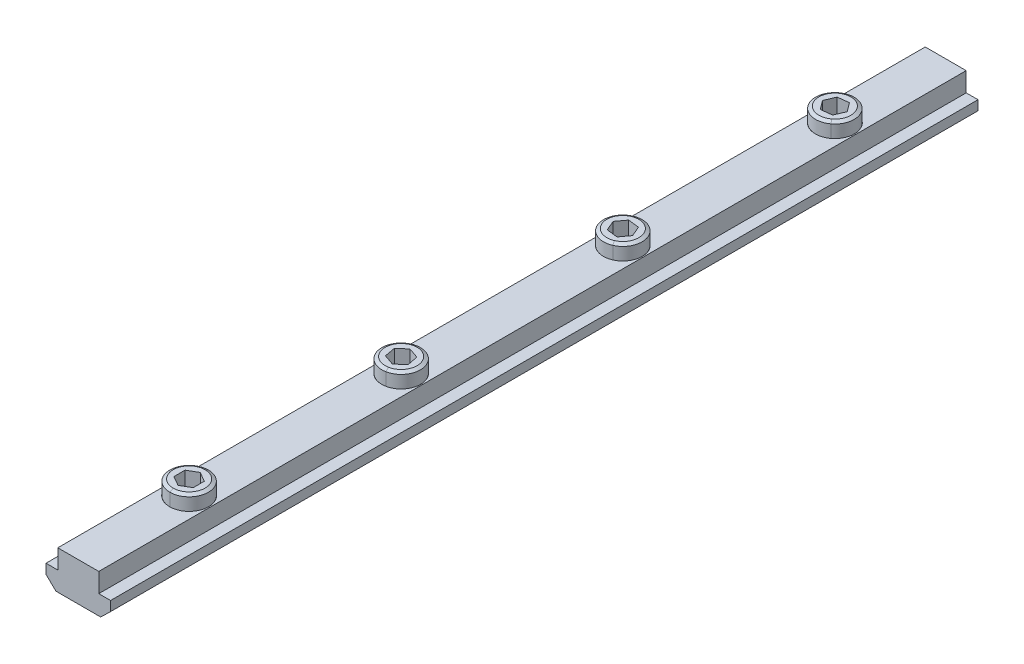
ISO-10303-21;
HEADER;
FILE_DESCRIPTION(('STEP AP214'),'2;1');
FILE_NAME('part.step','',(''),(''),'','','');
FILE_SCHEMA(('AUTOMOTIVE_DESIGN { 1 0 10303 214 1 1 1 1 }'));
ENDSEC;
DATA;
#1=APPLICATION_CONTEXT('core data for automotive mechanical design processes');
#2=APPLICATION_PROTOCOL_DEFINITION('international standard','automotive_design',2000,#1);
#3=PRODUCT_CONTEXT('',#1,'mechanical');
#4=PRODUCT('Part','Part','',(#3));
#5=PRODUCT_RELATED_PRODUCT_CATEGORY('part','',(#4));
#6=PRODUCT_DEFINITION_FORMATION('','',#4);
#7=PRODUCT_DEFINITION_CONTEXT('part definition',#1,'design');
#8=PRODUCT_DEFINITION('design','',#6,#7);
#9=PRODUCT_DEFINITION_SHAPE('','',#8);
#10=(LENGTH_UNIT() NAMED_UNIT(*) SI_UNIT(.MILLI.,.METRE.));
#11=(NAMED_UNIT(*) PLANE_ANGLE_UNIT() SI_UNIT($,.RADIAN.));
#12=(NAMED_UNIT(*) SI_UNIT($,.STERADIAN.) SOLID_ANGLE_UNIT());
#13=UNCERTAINTY_MEASURE_WITH_UNIT(LENGTH_MEASURE(1.E-05),#10,'distance_accuracy_value','');
#14=(GEOMETRIC_REPRESENTATION_CONTEXT(3) GLOBAL_UNCERTAINTY_ASSIGNED_CONTEXT((#13)) GLOBAL_UNIT_ASSIGNED_CONTEXT((#10,
#11,#12)) REPRESENTATION_CONTEXT('',''));
#15=CARTESIAN_POINT('',(0.,0.,0.));
#16=DIRECTION('',(0.,0.,1.));
#17=DIRECTION('',(1.,0.,0.));
#18=AXIS2_PLACEMENT_3D('',#15,#16,#17);
#19=CARTESIAN_POINT('',(2.18177264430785,-2.,23.7571006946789));
#20=DIRECTION('',(0.,-1.,0.));
#21=DIRECTION('',(0.,0.,-1.));
#22=AXIS2_PLACEMENT_3D('',#19,#20,#21);
#23=PLANE('',#22);
#24=DIRECTION('',(-0.756280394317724,0.,0.65424763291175));
#25=VECTOR('',#24,1.);
#26=CARTESIAN_POINT('',(2.18177264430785,-2.,23.7571006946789));
#27=LINE('',#26,#25);
#28=CARTESIAN_POINT('',(2.18177264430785,-2.,23.7571006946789));
#29=VERTEX_POINT('',#28);
#30=CARTESIAN_POINT('',(0.435217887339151,-2.,25.268020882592));
#31=VERTEX_POINT('',#30);
#32=EDGE_CURVE('P0_E215',#29,#31,#27,.T.);
#33=ORIENTED_EDGE('',*,*,#32,.F.);
#34=DIRECTION('',(-0.18845487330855,0.,-0.982081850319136));
#35=VECTOR('',#34,1.);
#36=CARTESIAN_POINT('',(2.18177264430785,-2.,23.7571006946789));
#37=LINE('',#36,#35);
#38=CARTESIAN_POINT('',(1.74655475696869,-2.,21.4890798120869));
#39=VERTEX_POINT('',#38);
#40=EDGE_CURVE('P0_E11',#29,#39,#37,.T.);
#41=ORIENTED_EDGE('',*,*,#40,.T.);
#42=DIRECTION('',(-0.944735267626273,0.,-0.327834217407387));
#43=VECTOR('',#42,1.);
#44=CARTESIAN_POINT('',(1.74655475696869,-2.,21.4890798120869));
#45=LINE('',#44,#43);
#46=CARTESIAN_POINT('',(-0.435217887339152,-2.,20.731979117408));
#47=VERTEX_POINT('',#46);
#48=EDGE_CURVE('P0_E43',#39,#47,#45,.T.);
#49=ORIENTED_EDGE('',*,*,#48,.T.);
#50=DIRECTION('',(0.756280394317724,0.,-0.654247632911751));
#51=VECTOR('',#50,1.);
#52=CARTESIAN_POINT('',(-2.18177264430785,-2.,22.2428993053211));
#53=LINE('',#52,#51);
#54=CARTESIAN_POINT('',(-2.18177264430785,-2.,22.2428993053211));
#55=VERTEX_POINT('',#54);
#56=EDGE_CURVE('P0_E230',#55,#47,#53,.T.);
#57=ORIENTED_EDGE('',*,*,#56,.F.);
#58=DIRECTION('',(-0.188454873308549,0.,-0.982081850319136));
#59=VECTOR('',#58,1.);
#60=CARTESIAN_POINT('',(-1.7465547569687,-2.,24.5109201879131));
#61=LINE('',#60,#59);
#62=CARTESIAN_POINT('',(-1.7465547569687,-2.,24.5109201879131));
#63=VERTEX_POINT('',#62);
#64=EDGE_CURVE('P0_E207',#63,#55,#61,.T.);
#65=ORIENTED_EDGE('',*,*,#64,.F.);
#66=DIRECTION('',(0.944735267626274,0.,0.327834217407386));
#67=VECTOR('',#66,1.);
#68=CARTESIAN_POINT('',(-1.7465547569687,-2.,24.5109201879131));
#69=LINE('',#68,#67);
#70=EDGE_CURVE('P0_E208',#63,#31,#69,.T.);
#71=ORIENTED_EDGE('',*,*,#70,.T.);
#72=EDGE_LOOP('',(#33,#41,#49,#57,#65,#71));
#73=FACE_BOUND('',#72,.T.);
#74=ADVANCED_FACE('P0_F16',(#73),#23,.F.);
#75=CARTESIAN_POINT('',(2.18177264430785,-2.,23.7571006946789));
#76=DIRECTION('',(0.982081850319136,0.,-0.18845487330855));
#77=DIRECTION('',(0.,-1.,0.));
#78=AXIS2_PLACEMENT_3D('',#75,#76,#77);
#79=PLANE('',#78);
#80=DIRECTION('',(-0.18845487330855,0.,-0.982081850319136));
#81=VECTOR('',#80,1.);
#82=CARTESIAN_POINT('',(2.18177264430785,3.,23.7571006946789));
#83=LINE('',#82,#81);
#84=CARTESIAN_POINT('',(2.18177264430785,3.,23.7571006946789));
#85=VERTEX_POINT('',#84);
#86=CARTESIAN_POINT('',(1.74655475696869,3.,21.4890798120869));
#87=VERTEX_POINT('',#86);
#88=EDGE_CURVE('P0_E127',#85,#87,#83,.T.);
#89=ORIENTED_EDGE('',*,*,#88,.T.);
#90=DIRECTION('',(0.,1.,0.));
#91=VECTOR('',#90,1.);
#92=CARTESIAN_POINT('',(1.74655475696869,-2.,21.4890798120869));
#93=LINE('',#92,#91);
#94=EDGE_CURVE('P0_E24',#39,#87,#93,.T.);
#95=ORIENTED_EDGE('',*,*,#94,.F.);
#96=ORIENTED_EDGE('',*,*,#40,.F.);
#97=DIRECTION('',(0.,1.,0.));
#98=VECTOR('',#97,1.);
#99=CARTESIAN_POINT('',(2.18177264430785,-2.,23.7571006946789));
#100=LINE('',#99,#98);
#101=EDGE_CURVE('P0_E155',#29,#85,#100,.T.);
#102=ORIENTED_EDGE('',*,*,#101,.T.);
#103=EDGE_LOOP('',(#89,#95,#96,#102));
#104=FACE_BOUND('',#103,.T.);
#105=ADVANCED_FACE('P0_F430',(#104),#79,.F.);
#106=CARTESIAN_POINT('',(1.74655475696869,-2.,21.4890798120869));
#107=DIRECTION('',(0.327834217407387,0.,-0.944735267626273));
#108=DIRECTION('',(0.,-1.,0.));
#109=AXIS2_PLACEMENT_3D('',#106,#107,#108);
#110=PLANE('',#109);
#111=DIRECTION('',(-0.944735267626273,0.,-0.327834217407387));
#112=VECTOR('',#111,1.);
#113=CARTESIAN_POINT('',(1.74655475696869,3.,21.4890798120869));
#114=LINE('',#113,#112);
#115=CARTESIAN_POINT('',(-0.435217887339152,3.,20.731979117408));
#116=VERTEX_POINT('',#115);
#117=EDGE_CURVE('P0_E197',#87,#116,#114,.T.);
#118=ORIENTED_EDGE('',*,*,#117,.T.);
#119=DIRECTION('',(0.,1.,0.));
#120=VECTOR('',#119,1.);
#121=CARTESIAN_POINT('',(-0.435217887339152,-2.,20.731979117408));
#122=LINE('',#121,#120);
#123=EDGE_CURVE('P0_E234',#47,#116,#122,.T.);
#124=ORIENTED_EDGE('',*,*,#123,.F.);
#125=ORIENTED_EDGE('',*,*,#48,.F.);
#126=ORIENTED_EDGE('',*,*,#94,.T.);
#127=EDGE_LOOP('',(#118,#124,#125,#126));
#128=FACE_BOUND('',#127,.T.);
#129=ADVANCED_FACE('P0_F425',(#128),#110,.F.);
#130=CARTESIAN_POINT('',(-2.18177264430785,-2.,22.2428993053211));
#131=DIRECTION('',(0.65424763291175,0.,0.756280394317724));
#132=DIRECTION('',(0.,-1.,0.));
#133=AXIS2_PLACEMENT_3D('',#130,#131,#132);
#134=PLANE('',#133);
#135=DIRECTION('',(0.756280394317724,0.,-0.654247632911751));
#136=VECTOR('',#135,1.);
#137=CARTESIAN_POINT('',(-2.18177264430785,3.,22.2428993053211));
#138=LINE('',#137,#136);
#139=CARTESIAN_POINT('',(-2.18177264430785,3.,22.2428993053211));
#140=VERTEX_POINT('',#139);
#141=EDGE_CURVE('P0_E167',#140,#116,#138,.T.);
#142=ORIENTED_EDGE('',*,*,#141,.F.);
#143=DIRECTION('',(0.,1.,0.));
#144=VECTOR('',#143,1.);
#145=CARTESIAN_POINT('',(-2.18177264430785,-2.,22.2428993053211));
#146=LINE('',#145,#144);
#147=EDGE_CURVE('P0_E227',#55,#140,#146,.T.);
#148=ORIENTED_EDGE('',*,*,#147,.F.);
#149=ORIENTED_EDGE('',*,*,#56,.T.);
#150=ORIENTED_EDGE('',*,*,#123,.T.);
#151=EDGE_LOOP('',(#142,#148,#149,#150));
#152=FACE_BOUND('',#151,.T.);
#153=ADVANCED_FACE('P0_F429',(#152),#134,.T.);
#154=CARTESIAN_POINT('',(-1.7465547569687,-2.,24.5109201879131));
#155=DIRECTION('',(0.982081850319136,0.,-0.188454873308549));
#156=DIRECTION('',(0.,-1.,0.));
#157=AXIS2_PLACEMENT_3D('',#154,#155,#156);
#158=PLANE('',#157);
#159=DIRECTION('',(-0.188454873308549,0.,-0.982081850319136));
#160=VECTOR('',#159,1.);
#161=CARTESIAN_POINT('',(-1.7465547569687,3.,24.5109201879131));
#162=LINE('',#161,#160);
#163=CARTESIAN_POINT('',(-1.7465547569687,3.,24.5109201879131));
#164=VERTEX_POINT('',#163);
#165=EDGE_CURVE('P0_E163',#164,#140,#162,.T.);
#166=ORIENTED_EDGE('',*,*,#165,.F.);
#167=DIRECTION('',(0.,1.,0.));
#168=VECTOR('',#167,1.);
#169=CARTESIAN_POINT('',(-1.7465547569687,-2.,24.5109201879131));
#170=LINE('',#169,#168);
#171=EDGE_CURVE('P0_E204',#63,#164,#170,.T.);
#172=ORIENTED_EDGE('',*,*,#171,.F.);
#173=ORIENTED_EDGE('',*,*,#64,.T.);
#174=ORIENTED_EDGE('',*,*,#147,.T.);
#175=EDGE_LOOP('',(#166,#172,#173,#174));
#176=FACE_BOUND('',#175,.T.);
#177=ADVANCED_FACE('P0_F404',(#176),#158,.T.);
#178=CARTESIAN_POINT('',(-1.7465547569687,-2.,24.5109201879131));
#179=DIRECTION('',(-0.327834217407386,0.,0.944735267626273));
#180=DIRECTION('',(0.,1.,0.));
#181=AXIS2_PLACEMENT_3D('',#178,#179,#180);
#182=PLANE('',#181);
#183=DIRECTION('',(0.944735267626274,0.,0.327834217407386));
#184=VECTOR('',#183,1.);
#185=CARTESIAN_POINT('',(-1.7465547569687,3.,24.5109201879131));
#186=LINE('',#185,#184);
#187=CARTESIAN_POINT('',(0.435217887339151,3.,25.268020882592));
#188=VERTEX_POINT('',#187);
#189=EDGE_CURVE('P0_E168',#164,#188,#186,.T.);
#190=ORIENTED_EDGE('',*,*,#189,.T.);
#191=DIRECTION('',(0.,1.,0.));
#192=VECTOR('',#191,1.);
#193=CARTESIAN_POINT('',(0.435217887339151,-2.,25.268020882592));
#194=LINE('',#193,#192);
#195=EDGE_CURVE('P0_E219',#31,#188,#194,.T.);
#196=ORIENTED_EDGE('',*,*,#195,.F.);
#197=ORIENTED_EDGE('',*,*,#70,.F.);
#198=ORIENTED_EDGE('',*,*,#171,.T.);
#199=EDGE_LOOP('',(#190,#196,#197,#198));
#200=FACE_BOUND('',#199,.T.);
#201=ADVANCED_FACE('P0_F398',(#200),#182,.F.);
#202=CARTESIAN_POINT('',(2.18177264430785,-2.,23.7571006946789));
#203=DIRECTION('',(-0.65424763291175,0.,-0.756280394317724));
#204=DIRECTION('',(-0.756280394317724,0.,0.65424763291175));
#205=AXIS2_PLACEMENT_3D('',#202,#203,#204);
#206=PLANE('',#205);
#207=DIRECTION('',(-0.756280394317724,0.,0.65424763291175));
#208=VECTOR('',#207,1.);
#209=CARTESIAN_POINT('',(2.18177264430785,3.,23.7571006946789));
#210=LINE('',#209,#208);
#211=EDGE_CURVE('P0_E181',#85,#188,#210,.T.);
#212=ORIENTED_EDGE('',*,*,#211,.F.);
#213=ORIENTED_EDGE('',*,*,#101,.F.);
#214=ORIENTED_EDGE('',*,*,#32,.T.);
#215=ORIENTED_EDGE('',*,*,#195,.T.);
#216=EDGE_LOOP('',(#212,#213,#214,#215));
#217=FACE_BOUND('',#216,.T.);
#218=ADVANCED_FACE('P0_F403',(#217),#206,.T.);
#219=CARTESIAN_POINT('',(0.,3.,23.));
#220=DIRECTION('',(0.,-1.,0.));
#221=DIRECTION('',(-0.188454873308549,0.,-0.982081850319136));
#222=AXIS2_PLACEMENT_3D('',#219,#220,#221);
#223=CONICAL_SURFACE('',#222,3.3095,1.0471975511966);
#224=DIRECTION('',(0.163206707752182,-0.5,0.850507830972));
#225=VECTOR('',#224,1.);
#226=CARTESIAN_POINT('',(0.623691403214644,3.,26.2501998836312));
#227=LINE('',#226,#225);
#228=CARTESIAN_POINT('',(0.623691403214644,3.,26.2501998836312));
#229=VERTEX_POINT('',#228);
#230=CARTESIAN_POINT('',(0.753819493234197,2.60133963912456,26.9283274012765));
#231=VERTEX_POINT('',#230);
#232=EDGE_CURVE('P0_E131',#229,#231,#227,.T.);
#233=ORIENTED_EDGE('',*,*,#232,.F.);
#234=CARTESIAN_POINT('',(0.,3.,23.));
#235=DIRECTION('',(0.,1.,0.));
#236=DIRECTION('',(0.188454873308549,0.,0.982081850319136));
#237=AXIS2_PLACEMENT_3D('',#234,#235,#236);
#238=CIRCLE('',#237,3.3095);
#239=CARTESIAN_POINT('',(-0.623691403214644,3.,19.7498001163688));
#240=VERTEX_POINT('',#239);
#241=EDGE_CURVE('P0_E118',#240,#229,#238,.T.);
#242=ORIENTED_EDGE('',*,*,#241,.F.);
#243=DIRECTION('',(-0.163206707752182,-0.5,-0.850507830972));
#244=VECTOR('',#243,1.);
#245=CARTESIAN_POINT('',(-0.623691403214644,3.,19.7498001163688));
#246=LINE('',#245,#244);
#247=CARTESIAN_POINT('',(-0.753819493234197,2.60133963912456,19.0716725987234));
#248=VERTEX_POINT('',#247);
#249=EDGE_CURVE('P0_E141',#240,#248,#246,.T.);
#250=ORIENTED_EDGE('',*,*,#249,.T.);
#251=CARTESIAN_POINT('',(0.,2.60133963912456,23.));
#252=DIRECTION('',(0.,1.,0.));
#253=DIRECTION('',(0.188454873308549,0.,0.982081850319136));
#254=AXIS2_PLACEMENT_3D('',#251,#252,#253);
#255=CIRCLE('',#254,4.);
#256=EDGE_CURVE('P0_E133',#248,#231,#255,.T.);
#257=ORIENTED_EDGE('',*,*,#256,.T.);
#258=EDGE_LOOP('',(#233,#242,#250,#257));
#259=FACE_BOUND('',#258,.T.);
#260=ADVANCED_FACE('P0_F132',(#259),#223,.T.);
#261=CARTESIAN_POINT('',(0.,15.7,23.));
#262=DIRECTION('',(0.,1.,0.));
#263=DIRECTION('',(0.188454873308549,0.,0.982081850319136));
#264=AXIS2_PLACEMENT_3D('',#261,#262,#263);
#265=CYLINDRICAL_SURFACE('',#264,4.);
#266=DIRECTION('',(0.,1.,0.));
#267=VECTOR('',#266,1.);
#268=CARTESIAN_POINT('',(-0.753819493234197,15.7,19.0716725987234));
#269=LINE('',#268,#267);
#270=CARTESIAN_POINT('',(-0.753819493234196,-5.7,19.0716725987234));
#271=VERTEX_POINT('',#270);
#272=EDGE_CURVE('P0_E151',#271,#248,#269,.T.);
#273=ORIENTED_EDGE('',*,*,#272,.F.);
#274=CARTESIAN_POINT('',(0.,-5.7,23.));
#275=DIRECTION('',(0.,1.,0.));
#276=DIRECTION('',(0.188454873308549,0.,0.982081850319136));
#277=AXIS2_PLACEMENT_3D('',#274,#275,#276);
#278=CIRCLE('',#277,4.);
#279=CARTESIAN_POINT('',(0.753819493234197,-5.7,26.9283274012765));
#280=VERTEX_POINT('',#279);
#281=EDGE_CURVE('P0_E156',#271,#280,#278,.T.);
#282=ORIENTED_EDGE('',*,*,#281,.T.);
#283=DIRECTION('',(0.,1.,0.));
#284=VECTOR('',#283,1.);
#285=CARTESIAN_POINT('',(0.753819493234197,15.7,26.9283274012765));
#286=LINE('',#285,#284);
#287=EDGE_CURVE('P0_E174',#280,#231,#286,.T.);
#288=ORIENTED_EDGE('',*,*,#287,.T.);
#289=ORIENTED_EDGE('',*,*,#256,.F.);
#290=EDGE_LOOP('',(#273,#282,#288,#289));
#291=FACE_BOUND('',#290,.T.);
#292=ADVANCED_FACE('P0_F511',(#291),#265,.T.);
#293=CARTESIAN_POINT('',(0.,-5.7,23.));
#294=DIRECTION('',(0.,1.,0.));
#295=DIRECTION('',(0.188454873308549,0.,0.982081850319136));
#296=AXIS2_PLACEMENT_3D('',#293,#294,#295);
#297=CONICAL_SURFACE('',#296,4.,0.785398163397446);
#298=DIRECTION('',(-0.133257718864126,0.707106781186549,-0.694436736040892));
#299=VECTOR('',#298,1.);
#300=CARTESIAN_POINT('',(-0.753819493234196,-5.7,19.0716725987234));
#301=LINE('',#300,#299);
#302=CARTESIAN_POINT('',(-0.131918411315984,-9.,22.3125427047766));
#303=VERTEX_POINT('',#302);
#304=EDGE_CURVE('P0_E160',#303,#271,#301,.T.);
#305=ORIENTED_EDGE('',*,*,#304,.F.);
#306=CARTESIAN_POINT('',(0.,-9.,23.));
#307=DIRECTION('',(0.,1.,0.));
#308=DIRECTION('',(0.188454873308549,0.,0.982081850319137));
#309=AXIS2_PLACEMENT_3D('',#306,#307,#308);
#310=CIRCLE('',#309,0.7);
#311=CARTESIAN_POINT('',(0.131918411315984,-9.,23.6874572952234));
#312=VERTEX_POINT('',#311);
#313=EDGE_CURVE('P0_E203',#303,#312,#310,.T.);
#314=ORIENTED_EDGE('',*,*,#313,.T.);
#315=DIRECTION('',(0.133257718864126,0.707106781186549,0.694436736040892));
#316=VECTOR('',#315,1.);
#317=CARTESIAN_POINT('',(0.753819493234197,-5.7,26.9283274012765));
#318=LINE('',#317,#316);
#319=EDGE_CURVE('P0_E128',#312,#280,#318,.T.);
#320=ORIENTED_EDGE('',*,*,#319,.T.);
#321=ORIENTED_EDGE('',*,*,#281,.F.);
#322=EDGE_LOOP('',(#305,#314,#320,#321));
#323=FACE_BOUND('',#322,.T.);
#324=ADVANCED_FACE('P0_F507',(#323),#297,.T.);
#325=CARTESIAN_POINT('',(0.687457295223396,-9.,22.868081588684));
#326=DIRECTION('',(0.,-1.,0.));
#327=DIRECTION('',(0.,0.,-1.));
#328=AXIS2_PLACEMENT_3D('',#325,#326,#327);
#329=PLANE('',#328);
#330=CARTESIAN_POINT('',(0.,-9.,23.));
#331=DIRECTION('',(0.,1.,0.));
#332=DIRECTION('',(0.188454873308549,0.,0.982081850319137));
#333=AXIS2_PLACEMENT_3D('',#330,#331,#332);
#334=CIRCLE('',#333,0.7);
#335=EDGE_CURVE('P0_E177',#312,#303,#334,.T.);
#336=ORIENTED_EDGE('',*,*,#335,.F.);
#337=ORIENTED_EDGE('',*,*,#313,.F.);
#338=EDGE_LOOP('',(#336,#337));
#339=FACE_BOUND('',#338,.T.);
#340=ADVANCED_FACE('P0_F487',(#339),#329,.T.);
#341=CARTESIAN_POINT('',(0.,3.,23.));
#342=DIRECTION('',(0.,1.,0.));
#343=DIRECTION('',(1.,0.,0.));
#344=AXIS2_PLACEMENT_3D('',#341,#342,#343);
#345=PLANE('',#344);
#346=ORIENTED_EDGE('',*,*,#88,.F.);
#347=ORIENTED_EDGE('',*,*,#211,.T.);
#348=ORIENTED_EDGE('',*,*,#189,.F.);
#349=ORIENTED_EDGE('',*,*,#165,.T.);
#350=ORIENTED_EDGE('',*,*,#141,.T.);
#351=ORIENTED_EDGE('',*,*,#117,.F.);
#352=EDGE_LOOP('',(#346,#347,#348,#349,#350,#351));
#353=FACE_BOUND('',#352,.T.);
#354=ORIENTED_EDGE('',*,*,#241,.T.);
#355=CARTESIAN_POINT('',(0.,3.,23.));
#356=DIRECTION('',(0.,1.,0.));
#357=DIRECTION('',(0.188454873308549,0.,0.982081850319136));
#358=AXIS2_PLACEMENT_3D('',#355,#356,#357);
#359=CIRCLE('',#358,3.3095);
#360=EDGE_CURVE('P0_E122',#229,#240,#359,.T.);
#361=ORIENTED_EDGE('',*,*,#360,.T.);
#362=EDGE_LOOP('',(#354,#361));
#363=FACE_BOUND('',#362,.T.);
#364=ADVANCED_FACE('P0_F120',(#353,#363),#345,.T.);
#365=CARTESIAN_POINT('',(0.,-5.7,23.));
#366=DIRECTION('',(0.,1.,0.));
#367=DIRECTION('',(0.188454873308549,0.,0.982081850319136));
#368=AXIS2_PLACEMENT_3D('',#365,#366,#367);
#369=CONICAL_SURFACE('',#368,4.,0.785398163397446);
#370=ORIENTED_EDGE('',*,*,#335,.T.);
#371=ORIENTED_EDGE('',*,*,#304,.T.);
#372=CARTESIAN_POINT('',(0.,-5.7,23.));
#373=DIRECTION('',(0.,1.,0.));
#374=DIRECTION('',(0.188454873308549,0.,0.982081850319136));
#375=AXIS2_PLACEMENT_3D('',#372,#373,#374);
#376=CIRCLE('',#375,4.);
#377=EDGE_CURVE('P0_E148',#280,#271,#376,.T.);
#378=ORIENTED_EDGE('',*,*,#377,.F.);
#379=ORIENTED_EDGE('',*,*,#319,.F.);
#380=EDGE_LOOP('',(#370,#371,#378,#379));
#381=FACE_BOUND('',#380,.T.);
#382=ADVANCED_FACE('P0_F442',(#381),#369,.T.);
#383=CARTESIAN_POINT('',(0.,15.7,23.));
#384=DIRECTION('',(0.,1.,0.));
#385=DIRECTION('',(0.188454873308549,0.,0.982081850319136));
#386=AXIS2_PLACEMENT_3D('',#383,#384,#385);
#387=CYLINDRICAL_SURFACE('',#386,4.);
#388=ORIENTED_EDGE('',*,*,#377,.T.);
#389=ORIENTED_EDGE('',*,*,#272,.T.);
#390=CARTESIAN_POINT('',(0.,2.60133963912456,23.));
#391=DIRECTION('',(0.,1.,0.));
#392=DIRECTION('',(0.188454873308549,0.,0.982081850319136));
#393=AXIS2_PLACEMENT_3D('',#390,#391,#392);
#394=CIRCLE('',#393,4.);
#395=EDGE_CURVE('P0_E138',#231,#248,#394,.T.);
#396=ORIENTED_EDGE('',*,*,#395,.F.);
#397=ORIENTED_EDGE('',*,*,#287,.F.);
#398=EDGE_LOOP('',(#388,#389,#396,#397));
#399=FACE_BOUND('',#398,.T.);
#400=ADVANCED_FACE('P0_F417',(#399),#387,.T.);
#401=CARTESIAN_POINT('',(0.,3.,23.));
#402=DIRECTION('',(0.,-1.,0.));
#403=DIRECTION('',(-0.188454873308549,0.,-0.982081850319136));
#404=AXIS2_PLACEMENT_3D('',#401,#402,#403);
#405=CONICAL_SURFACE('',#404,3.3095,1.0471975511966);
#406=ORIENTED_EDGE('',*,*,#360,.F.);
#407=ORIENTED_EDGE('',*,*,#232,.T.);
#408=ORIENTED_EDGE('',*,*,#395,.T.);
#409=ORIENTED_EDGE('',*,*,#249,.F.);
#410=EDGE_LOOP('',(#406,#407,#408,#409));
#411=FACE_BOUND('',#410,.T.);
#412=ADVANCED_FACE('P0_F140',(#411),#405,.T.);
#413=CLOSED_SHELL('',(#74,#105,#129,#153,#177,#201,#218,#260,#292,#324,#340,#364,#382,#400,#412));
#414=MANIFOLD_SOLID_BREP('P0_B1',#413);
#415=CARTESIAN_POINT('',(0.,0.,-67.));
#416=DIRECTION('',(0.,1.,0.));
#417=DIRECTION('',(0.,0.,1.));
#418=AXIS2_PLACEMENT_3D('',#415,#416,#417);
#419=CONICAL_SURFACE('',#418,4.025,0.785398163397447);
#420=DIRECTION('',(0.,0.707106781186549,-0.707106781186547));
#421=VECTOR('',#420,1.);
#422=CARTESIAN_POINT('',(0.,0.,-71.025));
#423=LINE('',#422,#421);
#424=CARTESIAN_POINT('',(0.,-0.625,-70.4));
#425=VERTEX_POINT('',#424);
#426=CARTESIAN_POINT('',(0.,0.,-71.025));
#427=VERTEX_POINT('',#426);
#428=EDGE_CURVE('P1_E948',#425,#427,#423,.T.);
#429=ORIENTED_EDGE('',*,*,#428,.F.);
#430=CARTESIAN_POINT('',(0.,-0.625,-67.));
#431=DIRECTION('',(0.,1.,0.));
#432=DIRECTION('',(0.,0.,1.));
#433=AXIS2_PLACEMENT_3D('',#430,#431,#432);
#434=CIRCLE('',#433,3.4);
#435=CARTESIAN_POINT('',(0.,-0.625,-63.6));
#436=VERTEX_POINT('',#435);
#437=EDGE_CURVE('P1_E11',#436,#425,#434,.T.);
#438=ORIENTED_EDGE('',*,*,#437,.F.);
#439=DIRECTION('',(0.,0.707106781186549,0.707106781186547));
#440=VECTOR('',#439,1.);
#441=CARTESIAN_POINT('',(0.,0.,-62.975));
#442=LINE('',#441,#440);
#443=CARTESIAN_POINT('',(0.,0.,-62.975));
#444=VERTEX_POINT('',#443);
#445=EDGE_CURVE('P1_E930',#436,#444,#442,.T.);
#446=ORIENTED_EDGE('',*,*,#445,.T.);
#447=CARTESIAN_POINT('',(0.,0.,-67.));
#448=DIRECTION('',(0.,1.,0.));
#449=DIRECTION('',(0.,0.,1.));
#450=AXIS2_PLACEMENT_3D('',#447,#448,#449);
#451=CIRCLE('',#450,4.025);
#452=EDGE_CURVE('P1_E539',#444,#427,#451,.T.);
#453=ORIENTED_EDGE('',*,*,#452,.T.);
#454=EDGE_LOOP('',(#429,#438,#446,#453));
#455=FACE_BOUND('',#454,.T.);
#456=ADVANCED_FACE('P1_F17',(#455),#419,.F.);
#457=CARTESIAN_POINT('',(0.,0.,-67.));
#458=DIRECTION('',(0.,1.,0.));
#459=DIRECTION('',(0.,0.,1.));
#460=AXIS2_PLACEMENT_3D('',#457,#458,#459);
#461=CYLINDRICAL_SURFACE('',#460,3.4);
#462=DIRECTION('',(0.,1.,0.));
#463=VECTOR('',#462,1.);
#464=CARTESIAN_POINT('',(0.,0.,-70.4));
#465=LINE('',#464,#463);
#466=CARTESIAN_POINT('',(0.,-6.75,-70.4));
#467=VERTEX_POINT('',#466);
#468=EDGE_CURVE('P1_E332',#467,#425,#465,.T.);
#469=ORIENTED_EDGE('',*,*,#468,.F.);
#470=CARTESIAN_POINT('',(0.,-6.75,-67.));
#471=DIRECTION('',(0.,1.,0.));
#472=DIRECTION('',(0.,0.,1.));
#473=AXIS2_PLACEMENT_3D('',#470,#471,#472);
#474=CIRCLE('',#473,3.4);
#475=CARTESIAN_POINT('',(0.,-6.75,-63.6));
#476=VERTEX_POINT('',#475);
#477=EDGE_CURVE('P1_E26',#476,#467,#474,.T.);
#478=ORIENTED_EDGE('',*,*,#477,.F.);
#479=DIRECTION('',(0.,1.,0.));
#480=VECTOR('',#479,1.);
#481=CARTESIAN_POINT('',(0.,0.,-63.6));
#482=LINE('',#481,#480);
#483=EDGE_CURVE('P1_E336',#476,#436,#482,.T.);
#484=ORIENTED_EDGE('',*,*,#483,.T.);
#485=ORIENTED_EDGE('',*,*,#437,.T.);
#486=EDGE_LOOP('',(#469,#478,#484,#485));
#487=FACE_BOUND('',#486,.T.);
#488=ADVANCED_FACE('P1_F1502',(#487),#461,.F.);
#489=CARTESIAN_POINT('',(0.,-6.75,-67.));
#490=DIRECTION('',(0.,-1.,0.));
#491=DIRECTION('',(0.,0.,-1.));
#492=AXIS2_PLACEMENT_3D('',#489,#490,#491);
#493=CONICAL_SURFACE('',#492,3.4,0.785398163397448);
#494=DIRECTION('',(0.,-0.707106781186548,0.707106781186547));
#495=VECTOR('',#494,1.);
#496=CARTESIAN_POINT('',(0.,-6.75,-63.6));
#497=LINE('',#496,#495);
#498=CARTESIAN_POINT('',(0.,-8.,-62.35));
#499=VERTEX_POINT('',#498);
#500=EDGE_CURVE('P1_E342',#476,#499,#497,.T.);
#501=ORIENTED_EDGE('',*,*,#500,.F.);
#502=ORIENTED_EDGE('',*,*,#477,.T.);
#503=DIRECTION('',(0.,-0.707106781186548,-0.707106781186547));
#504=VECTOR('',#503,1.);
#505=CARTESIAN_POINT('',(0.,-6.75,-70.4));
#506=LINE('',#505,#504);
#507=CARTESIAN_POINT('',(0.,-8.,-71.65));
#508=VERTEX_POINT('',#507);
#509=EDGE_CURVE('P1_E320',#467,#508,#506,.T.);
#510=ORIENTED_EDGE('',*,*,#509,.T.);
#511=CARTESIAN_POINT('',(0.,-8.,-67.));
#512=DIRECTION('',(0.,1.,0.));
#513=DIRECTION('',(0.,0.,1.));
#514=AXIS2_PLACEMENT_3D('',#511,#512,#513);
#515=CIRCLE('',#514,4.65);
#516=CARTESIAN_POINT('',(4.65,-8.,-67.));
#517=VERTEX_POINT('',#516);
#518=EDGE_CURVE('P1_E580',#517,#508,#515,.T.);
#519=ORIENTED_EDGE('',*,*,#518,.F.);
#520=CARTESIAN_POINT('',(0.,-8.,-67.));
#521=DIRECTION('',(0.,1.,0.));
#522=DIRECTION('',(0.,0.,1.));
#523=AXIS2_PLACEMENT_3D('',#520,#521,#522);
#524=CIRCLE('',#523,4.65);
#525=EDGE_CURVE('P1_E370',#499,#517,#524,.T.);
#526=ORIENTED_EDGE('',*,*,#525,.F.);
#527=EDGE_LOOP('',(#501,#502,#510,#519,#526));
#528=FACE_BOUND('',#527,.T.);
#529=ADVANCED_FACE('P1_F1506',(#528),#493,.F.);
#530=CARTESIAN_POINT('',(0.,0.,-23.));
#531=DIRECTION('',(0.,1.,0.));
#532=DIRECTION('',(0.,0.,1.));
#533=AXIS2_PLACEMENT_3D('',#530,#531,#532);
#534=CONICAL_SURFACE('',#533,4.025,0.785398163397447);
#535=DIRECTION('',(0.,0.707106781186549,-0.707106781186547));
#536=VECTOR('',#535,1.);
#537=CARTESIAN_POINT('',(0.,0.,-27.025));
#538=LINE('',#537,#536);
#539=CARTESIAN_POINT('',(0.,-0.625,-26.4));
#540=VERTEX_POINT('',#539);
#541=CARTESIAN_POINT('',(0.,0.,-27.025));
#542=VERTEX_POINT('',#541);
#543=EDGE_CURVE('P1_E308',#540,#542,#538,.T.);
#544=ORIENTED_EDGE('',*,*,#543,.F.);
#545=CARTESIAN_POINT('',(0.,-0.625,-23.));
#546=DIRECTION('',(0.,1.,0.));
#547=DIRECTION('',(0.,0.,1.));
#548=AXIS2_PLACEMENT_3D('',#545,#546,#547);
#549=CIRCLE('',#548,3.4);
#550=CARTESIAN_POINT('',(0.,-0.625,-19.6));
#551=VERTEX_POINT('',#550);
#552=EDGE_CURVE('P1_E284',#551,#540,#549,.T.);
#553=ORIENTED_EDGE('',*,*,#552,.F.);
#554=DIRECTION('',(0.,0.707106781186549,0.707106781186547));
#555=VECTOR('',#554,1.);
#556=CARTESIAN_POINT('',(0.,0.,-18.975));
#557=LINE('',#556,#555);
#558=CARTESIAN_POINT('',(0.,0.,-18.975));
#559=VERTEX_POINT('',#558);
#560=EDGE_CURVE('P1_E318',#551,#559,#557,.T.);
#561=ORIENTED_EDGE('',*,*,#560,.T.);
#562=CARTESIAN_POINT('',(0.,0.,-23.));
#563=DIRECTION('',(0.,1.,0.));
#564=DIRECTION('',(0.,0.,1.));
#565=AXIS2_PLACEMENT_3D('',#562,#563,#564);
#566=CIRCLE('',#565,4.025);
#567=EDGE_CURVE('P1_E310',#559,#542,#566,.T.);
#568=ORIENTED_EDGE('',*,*,#567,.T.);
#569=EDGE_LOOP('',(#544,#553,#561,#568));
#570=FACE_BOUND('',#569,.T.);
#571=ADVANCED_FACE('P1_F309',(#570),#534,.F.);
#572=CARTESIAN_POINT('',(0.,0.,-23.));
#573=DIRECTION('',(0.,1.,0.));
#574=DIRECTION('',(0.,0.,1.));
#575=AXIS2_PLACEMENT_3D('',#572,#573,#574);
#576=CYLINDRICAL_SURFACE('',#575,3.4);
#577=DIRECTION('',(0.,1.,0.));
#578=VECTOR('',#577,1.);
#579=CARTESIAN_POINT('',(0.,0.,-26.4));
#580=LINE('',#579,#578);
#581=CARTESIAN_POINT('',(0.,-6.75,-26.4));
#582=VERTEX_POINT('',#581);
#583=EDGE_CURVE('P1_E287',#582,#540,#580,.T.);
#584=ORIENTED_EDGE('',*,*,#583,.F.);
#585=CARTESIAN_POINT('',(0.,-6.75,-23.));
#586=DIRECTION('',(0.,1.,0.));
#587=DIRECTION('',(0.,0.,1.));
#588=AXIS2_PLACEMENT_3D('',#585,#586,#587);
#589=CIRCLE('',#588,3.4);
#590=CARTESIAN_POINT('',(0.,-6.75,-19.6));
#591=VERTEX_POINT('',#590);
#592=EDGE_CURVE('P1_E296',#591,#582,#589,.T.);
#593=ORIENTED_EDGE('',*,*,#592,.F.);
#594=DIRECTION('',(0.,1.,0.));
#595=VECTOR('',#594,1.);
#596=CARTESIAN_POINT('',(0.,0.,-19.6));
#597=LINE('',#596,#595);
#598=EDGE_CURVE('P1_E290',#591,#551,#597,.T.);
#599=ORIENTED_EDGE('',*,*,#598,.T.);
#600=ORIENTED_EDGE('',*,*,#552,.T.);
#601=EDGE_LOOP('',(#584,#593,#599,#600));
#602=FACE_BOUND('',#601,.T.);
#603=ADVANCED_FACE('P1_F286',(#602),#576,.F.);
#604=CARTESIAN_POINT('',(0.,-6.75,-23.));
#605=DIRECTION('',(0.,-1.,0.));
#606=DIRECTION('',(0.,0.,-1.));
#607=AXIS2_PLACEMENT_3D('',#604,#605,#606);
#608=CONICAL_SURFACE('',#607,3.4,0.785398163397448);
#609=DIRECTION('',(0.,-0.707106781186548,0.707106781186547));
#610=VECTOR('',#609,1.);
#611=CARTESIAN_POINT('',(0.,-6.75,-19.6));
#612=LINE('',#611,#610);
#613=CARTESIAN_POINT('',(0.,-8.,-18.35));
#614=VERTEX_POINT('',#613);
#615=EDGE_CURVE('P1_E383',#591,#614,#612,.T.);
#616=ORIENTED_EDGE('',*,*,#615,.F.);
#617=ORIENTED_EDGE('',*,*,#592,.T.);
#618=DIRECTION('',(0.,-0.707106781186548,-0.707106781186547));
#619=VECTOR('',#618,1.);
#620=CARTESIAN_POINT('',(0.,-6.75,-26.4));
#621=LINE('',#620,#619);
#622=CARTESIAN_POINT('',(0.,-8.,-27.65));
#623=VERTEX_POINT('',#622);
#624=EDGE_CURVE('P1_E416',#582,#623,#621,.T.);
#625=ORIENTED_EDGE('',*,*,#624,.T.);
#626=CARTESIAN_POINT('',(0.,-8.,-23.));
#627=DIRECTION('',(0.,1.,0.));
#628=DIRECTION('',(0.,0.,1.));
#629=AXIS2_PLACEMENT_3D('',#626,#627,#628);
#630=CIRCLE('',#629,4.65);
#631=CARTESIAN_POINT('',(4.65,-8.,-23.));
#632=VERTEX_POINT('',#631);
#633=EDGE_CURVE('P1_E511',#632,#623,#630,.T.);
#634=ORIENTED_EDGE('',*,*,#633,.F.);
#635=CARTESIAN_POINT('',(0.,-8.,-23.));
#636=DIRECTION('',(0.,-1.,0.));
#637=DIRECTION('',(0.,0.,-1.));
#638=AXIS2_PLACEMENT_3D('',#635,#636,#637);
#639=CIRCLE('',#638,4.65);
#640=EDGE_CURVE('P1_E385',#632,#614,#639,.T.);
#641=ORIENTED_EDGE('',*,*,#640,.T.);
#642=EDGE_LOOP('',(#616,#617,#625,#634,#641));
#643=FACE_BOUND('',#642,.T.);
#644=ADVANCED_FACE('P1_F1460',(#643),#608,.F.);
#645=CARTESIAN_POINT('',(0.,0.,67.));
#646=DIRECTION('',(0.,1.,0.));
#647=DIRECTION('',(0.,0.,1.));
#648=AXIS2_PLACEMENT_3D('',#645,#646,#647);
#649=CONICAL_SURFACE('',#648,4.025,0.785398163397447);
#650=DIRECTION('',(0.,0.707106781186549,-0.707106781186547));
#651=VECTOR('',#650,1.);
#652=CARTESIAN_POINT('',(0.,0.,62.975));
#653=LINE('',#652,#651);
#654=CARTESIAN_POINT('',(0.,-0.625,63.6));
#655=VERTEX_POINT('',#654);
#656=CARTESIAN_POINT('',(0.,0.,62.975));
#657=VERTEX_POINT('',#656);
#658=EDGE_CURVE('P1_E421',#655,#657,#653,.T.);
#659=ORIENTED_EDGE('',*,*,#658,.F.);
#660=CARTESIAN_POINT('',(0.,-0.625,67.));
#661=DIRECTION('',(0.,1.,0.));
#662=DIRECTION('',(0.,0.,1.));
#663=AXIS2_PLACEMENT_3D('',#660,#661,#662);
#664=CIRCLE('',#663,3.4);
#665=CARTESIAN_POINT('',(0.,-0.625,70.4));
#666=VERTEX_POINT('',#665);
#667=EDGE_CURVE('P1_E20',#666,#655,#664,.T.);
#668=ORIENTED_EDGE('',*,*,#667,.F.);
#669=DIRECTION('',(0.,0.707106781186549,0.707106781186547));
#670=VECTOR('',#669,1.);
#671=CARTESIAN_POINT('',(0.,0.,71.025));
#672=LINE('',#671,#670);
#673=CARTESIAN_POINT('',(0.,0.,71.025));
#674=VERTEX_POINT('',#673);
#675=EDGE_CURVE('P1_E357',#666,#674,#672,.T.);
#676=ORIENTED_EDGE('',*,*,#675,.T.);
#677=CARTESIAN_POINT('',(0.,0.,67.));
#678=DIRECTION('',(0.,1.,0.));
#679=DIRECTION('',(0.,0.,1.));
#680=AXIS2_PLACEMENT_3D('',#677,#678,#679);
#681=CIRCLE('',#680,4.025);
#682=EDGE_CURVE('P1_E347',#674,#657,#681,.T.);
#683=ORIENTED_EDGE('',*,*,#682,.T.);
#684=EDGE_LOOP('',(#659,#668,#676,#683));
#685=FACE_BOUND('',#684,.T.);
#686=ADVANCED_FACE('P1_F1455',(#685),#649,.F.);
#687=CARTESIAN_POINT('',(0.,0.,67.));
#688=DIRECTION('',(0.,1.,0.));
#689=DIRECTION('',(0.,0.,1.));
#690=AXIS2_PLACEMENT_3D('',#687,#688,#689);
#691=CYLINDRICAL_SURFACE('',#690,3.4);
#692=DIRECTION('',(0.,1.,0.));
#693=VECTOR('',#692,1.);
#694=CARTESIAN_POINT('',(0.,0.,63.6));
#695=LINE('',#694,#693);
#696=CARTESIAN_POINT('',(0.,-6.75,63.6));
#697=VERTEX_POINT('',#696);
#698=EDGE_CURVE('P1_E439',#697,#655,#695,.T.);
#699=ORIENTED_EDGE('',*,*,#698,.F.);
#700=CARTESIAN_POINT('',(0.,-6.75,67.));
#701=DIRECTION('',(0.,1.,0.));
#702=DIRECTION('',(0.,0.,1.));
#703=AXIS2_PLACEMENT_3D('',#700,#701,#702);
#704=CIRCLE('',#703,3.4);
#705=CARTESIAN_POINT('',(0.,-6.75,70.4));
#706=VERTEX_POINT('',#705);
#707=EDGE_CURVE('P1_E397',#706,#697,#704,.T.);
#708=ORIENTED_EDGE('',*,*,#707,.F.);
#709=DIRECTION('',(0.,1.,0.));
#710=VECTOR('',#709,1.);
#711=CARTESIAN_POINT('',(0.,0.,70.4));
#712=LINE('',#711,#710);
#713=EDGE_CURVE('P1_E443',#706,#666,#712,.T.);
#714=ORIENTED_EDGE('',*,*,#713,.T.);
#715=ORIENTED_EDGE('',*,*,#667,.T.);
#716=EDGE_LOOP('',(#699,#708,#714,#715));
#717=FACE_BOUND('',#716,.T.);
#718=ADVANCED_FACE('P1_F1459',(#717),#691,.F.);
#719=CARTESIAN_POINT('',(0.,-6.75,67.));
#720=DIRECTION('',(0.,-1.,0.));
#721=DIRECTION('',(0.,0.,-1.));
#722=AXIS2_PLACEMENT_3D('',#719,#720,#721);
#723=CONICAL_SURFACE('',#722,3.4,0.785398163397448);
#724=DIRECTION('',(0.,-0.707106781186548,0.707106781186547));
#725=VECTOR('',#724,1.);
#726=CARTESIAN_POINT('',(0.,-6.75,70.4));
#727=LINE('',#726,#725);
#728=CARTESIAN_POINT('',(0.,-8.,71.65));
#729=VERTEX_POINT('',#728);
#730=EDGE_CURVE('P1_E453',#706,#729,#727,.T.);
#731=ORIENTED_EDGE('',*,*,#730,.F.);
#732=ORIENTED_EDGE('',*,*,#707,.T.);
#733=DIRECTION('',(0.,-0.707106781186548,-0.707106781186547));
#734=VECTOR('',#733,1.);
#735=CARTESIAN_POINT('',(0.,-6.75,63.6));
#736=LINE('',#735,#734);
#737=CARTESIAN_POINT('',(0.,-8.,62.35));
#738=VERTEX_POINT('',#737);
#739=EDGE_CURVE('P1_E378',#697,#738,#736,.T.);
#740=ORIENTED_EDGE('',*,*,#739,.T.);
#741=CARTESIAN_POINT('',(0.,-8.,67.));
#742=DIRECTION('',(0.,1.,0.));
#743=DIRECTION('',(0.,0.,1.));
#744=AXIS2_PLACEMENT_3D('',#741,#742,#743);
#745=CIRCLE('',#744,4.65);
#746=CARTESIAN_POINT('',(4.65,-8.,67.));
#747=VERTEX_POINT('',#746);
#748=EDGE_CURVE('P1_E471',#747,#738,#745,.T.);
#749=ORIENTED_EDGE('',*,*,#748,.F.);
#750=CARTESIAN_POINT('',(0.,-8.,67.));
#751=DIRECTION('',(0.,1.,0.));
#752=DIRECTION('',(0.,0.,1.));
#753=AXIS2_PLACEMENT_3D('',#750,#751,#752);
#754=CIRCLE('',#753,4.65);
#755=EDGE_CURVE('P1_E430',#729,#747,#754,.T.);
#756=ORIENTED_EDGE('',*,*,#755,.F.);
#757=EDGE_LOOP('',(#731,#732,#740,#749,#756));
#758=FACE_BOUND('',#757,.T.);
#759=ADVANCED_FACE('P1_F1365',(#758),#723,.F.);
#760=CARTESIAN_POINT('',(0.,0.,23.));
#761=DIRECTION('',(0.,1.,0.));
#762=DIRECTION('',(0.,0.,1.));
#763=AXIS2_PLACEMENT_3D('',#760,#761,#762);
#764=CONICAL_SURFACE('',#763,4.025,0.785398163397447);
#765=DIRECTION('',(0.,0.707106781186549,-0.707106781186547));
#766=VECTOR('',#765,1.);
#767=CARTESIAN_POINT('',(0.,0.,18.975));
#768=LINE('',#767,#766);
#769=CARTESIAN_POINT('',(0.,-0.625,19.6));
#770=VERTEX_POINT('',#769);
#771=CARTESIAN_POINT('',(0.,0.,18.975));
#772=VERTEX_POINT('',#771);
#773=EDGE_CURVE('P1_E351',#770,#772,#768,.T.);
#774=ORIENTED_EDGE('',*,*,#773,.F.);
#775=CARTESIAN_POINT('',(0.,-0.625,23.));
#776=DIRECTION('',(0.,1.,0.));
#777=DIRECTION('',(0.,0.,1.));
#778=AXIS2_PLACEMENT_3D('',#775,#776,#777);
#779=CIRCLE('',#778,3.4);
#780=CARTESIAN_POINT('',(0.,-0.625,26.4));
#781=VERTEX_POINT('',#780);
#782=EDGE_CURVE('P1_E341',#781,#770,#779,.T.);
#783=ORIENTED_EDGE('',*,*,#782,.F.);
#784=DIRECTION('',(0.,0.707106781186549,0.707106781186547));
#785=VECTOR('',#784,1.);
#786=CARTESIAN_POINT('',(0.,0.,27.025));
#787=LINE('',#786,#785);
#788=CARTESIAN_POINT('',(0.,0.,27.025));
#789=VERTEX_POINT('',#788);
#790=EDGE_CURVE('P1_E486',#781,#789,#787,.T.);
#791=ORIENTED_EDGE('',*,*,#790,.T.);
#792=CARTESIAN_POINT('',(0.,0.,23.));
#793=DIRECTION('',(0.,1.,0.));
#794=DIRECTION('',(0.,0.,1.));
#795=AXIS2_PLACEMENT_3D('',#792,#793,#794);
#796=CIRCLE('',#795,4.025);
#797=EDGE_CURVE('P1_E350',#789,#772,#796,.T.);
#798=ORIENTED_EDGE('',*,*,#797,.T.);
#799=EDGE_LOOP('',(#774,#783,#791,#798));
#800=FACE_BOUND('',#799,.T.);
#801=ADVANCED_FACE('P1_F1318',(#800),#764,.F.);
#802=CARTESIAN_POINT('',(0.,0.,23.));
#803=DIRECTION('',(0.,1.,0.));
#804=DIRECTION('',(0.,0.,1.));
#805=AXIS2_PLACEMENT_3D('',#802,#803,#804);
#806=CYLINDRICAL_SURFACE('',#805,3.4);
#807=DIRECTION('',(0.,1.,0.));
#808=VECTOR('',#807,1.);
#809=CARTESIAN_POINT('',(0.,0.,19.6));
#810=LINE('',#809,#808);
#811=CARTESIAN_POINT('',(0.,-6.75,19.6));
#812=VERTEX_POINT('',#811);
#813=EDGE_CURVE('P1_E477',#812,#770,#810,.T.);
#814=ORIENTED_EDGE('',*,*,#813,.F.);
#815=CARTESIAN_POINT('',(0.,-6.75,23.));
#816=DIRECTION('',(0.,1.,0.));
#817=DIRECTION('',(0.,0.,1.));
#818=AXIS2_PLACEMENT_3D('',#815,#816,#817);
#819=CIRCLE('',#818,3.4);
#820=CARTESIAN_POINT('',(0.,-6.75,26.4));
#821=VERTEX_POINT('',#820);
#822=EDGE_CURVE('P1_E338',#821,#812,#819,.T.);
#823=ORIENTED_EDGE('',*,*,#822,.F.);
#824=DIRECTION('',(0.,1.,0.));
#825=VECTOR('',#824,1.);
#826=CARTESIAN_POINT('',(0.,0.,26.4));
#827=LINE('',#826,#825);
#828=EDGE_CURVE('P1_E473',#821,#781,#827,.T.);
#829=ORIENTED_EDGE('',*,*,#828,.T.);
#830=ORIENTED_EDGE('',*,*,#782,.T.);
#831=EDGE_LOOP('',(#814,#823,#829,#830));
#832=FACE_BOUND('',#831,.T.);
#833=ADVANCED_FACE('P1_F1313',(#832),#806,.F.);
#834=CARTESIAN_POINT('',(0.,-6.75,23.));
#835=DIRECTION('',(0.,-1.,0.));
#836=DIRECTION('',(0.,0.,-1.));
#837=AXIS2_PLACEMENT_3D('',#834,#835,#836);
#838=CONICAL_SURFACE('',#837,3.4,0.785398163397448);
#839=DIRECTION('',(0.,-0.707106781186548,0.707106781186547));
#840=VECTOR('',#839,1.);
#841=CARTESIAN_POINT('',(0.,-6.75,26.4));
#842=LINE('',#841,#840);
#843=CARTESIAN_POINT('',(0.,-8.,27.65));
#844=VERTEX_POINT('',#843);
#845=EDGE_CURVE('P1_E330',#821,#844,#842,.T.);
#846=ORIENTED_EDGE('',*,*,#845,.F.);
#847=ORIENTED_EDGE('',*,*,#822,.T.);
#848=DIRECTION('',(0.,-0.707106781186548,-0.707106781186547));
#849=VECTOR('',#848,1.);
#850=CARTESIAN_POINT('',(0.,-6.75,19.6));
#851=LINE('',#850,#849);
#852=CARTESIAN_POINT('',(0.,-8.,18.35));
#853=VERTEX_POINT('',#852);
#854=EDGE_CURVE('P1_E366',#812,#853,#851,.T.);
#855=ORIENTED_EDGE('',*,*,#854,.T.);
#856=CARTESIAN_POINT('',(0.,-8.,23.));
#857=DIRECTION('',(0.,1.,0.));
#858=DIRECTION('',(0.,0.,1.));
#859=AXIS2_PLACEMENT_3D('',#856,#857,#858);
#860=CIRCLE('',#859,4.65);
#861=CARTESIAN_POINT('',(4.65,-8.,23.));
#862=VERTEX_POINT('',#861);
#863=EDGE_CURVE('P1_E412',#862,#853,#860,.T.);
#864=ORIENTED_EDGE('',*,*,#863,.F.);
#865=CARTESIAN_POINT('',(0.,-8.,23.));
#866=DIRECTION('',(0.,1.,0.));
#867=DIRECTION('',(0.,0.,1.));
#868=AXIS2_PLACEMENT_3D('',#865,#866,#867);
#869=CIRCLE('',#868,4.65);
#870=EDGE_CURVE('P1_E543',#844,#862,#869,.T.);
#871=ORIENTED_EDGE('',*,*,#870,.F.);
#872=EDGE_LOOP('',(#846,#847,#855,#864,#871));
#873=FACE_BOUND('',#872,.T.);
#874=ADVANCED_FACE('P1_F1317',(#873),#838,.F.);
#875=CARTESIAN_POINT('',(0.,0.,90.));
#876=DIRECTION('',(0.,0.,1.));
#877=DIRECTION('',(1.,0.,0.));
#878=AXIS2_PLACEMENT_3D('',#875,#876,#877);
#879=PLANE('',#878);
#880=DIRECTION('',(-1.,0.,0.));
#881=VECTOR('',#880,1.);
#882=CARTESIAN_POINT('',(4.25,-4.,90.));
#883=LINE('',#882,#881);
#884=CARTESIAN_POINT('',(6.7,-4.,90.));
#885=VERTEX_POINT('',#884);
#886=CARTESIAN_POINT('',(4.25,-4.,90.));
#887=VERTEX_POINT('',#886);
#888=EDGE_CURVE('P1_E550',#885,#887,#883,.T.);
#889=ORIENTED_EDGE('',*,*,#888,.T.);
#890=DIRECTION('',(0.,1.,0.));
#891=VECTOR('',#890,1.);
#892=CARTESIAN_POINT('',(4.25,0.,90.));
#893=LINE('',#892,#891);
#894=CARTESIAN_POINT('',(4.25,0.,90.));
#895=VERTEX_POINT('',#894);
#896=EDGE_CURVE('P1_E51',#887,#895,#893,.T.);
#897=ORIENTED_EDGE('',*,*,#896,.T.);
#898=DIRECTION('',(-1.,0.,0.));
#899=VECTOR('',#898,1.);
#900=CARTESIAN_POINT('',(-4.25,0.,90.));
#901=LINE('',#900,#899);
#902=CARTESIAN_POINT('',(-4.25,0.,90.));
#903=VERTEX_POINT('',#902);
#904=EDGE_CURVE('P1_E613',#895,#903,#901,.T.);
#905=ORIENTED_EDGE('',*,*,#904,.T.);
#906=DIRECTION('',(0.,-1.,0.));
#907=VECTOR('',#906,1.);
#908=CARTESIAN_POINT('',(-4.25,0.,90.));
#909=LINE('',#908,#907);
#910=CARTESIAN_POINT('',(-4.25,-4.,90.));
#911=VERTEX_POINT('',#910);
#912=EDGE_CURVE('P1_E603',#903,#911,#909,.T.);
#913=ORIENTED_EDGE('',*,*,#912,.T.);
#914=DIRECTION('',(-1.,0.,0.));
#915=VECTOR('',#914,1.);
#916=CARTESIAN_POINT('',(-4.25,-4.,90.));
#917=LINE('',#916,#915);
#918=CARTESIAN_POINT('',(-6.7,-4.,90.));
#919=VERTEX_POINT('',#918);
#920=EDGE_CURVE('P1_E593',#911,#919,#917,.T.);
#921=ORIENTED_EDGE('',*,*,#920,.T.);
#922=DIRECTION('',(0.,-1.,0.));
#923=VECTOR('',#922,1.);
#924=CARTESIAN_POINT('',(-6.7,-4.,90.));
#925=LINE('',#924,#923);
#926=CARTESIAN_POINT('',(-6.7,-6.,90.));
#927=VERTEX_POINT('',#926);
#928=EDGE_CURVE('P1_E463',#919,#927,#925,.T.);
#929=ORIENTED_EDGE('',*,*,#928,.T.);
#930=DIRECTION('',(0.715781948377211,-0.698323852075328,0.));
#931=VECTOR('',#930,1.);
#932=CARTESIAN_POINT('',(-6.7,-6.,90.));
#933=LINE('',#932,#931);
#934=CARTESIAN_POINT('',(-4.65,-8.,90.));
#935=VERTEX_POINT('',#934);
#936=EDGE_CURVE('P1_E519',#927,#935,#933,.T.);
#937=ORIENTED_EDGE('',*,*,#936,.T.);
#938=DIRECTION('',(1.,0.,0.));
#939=VECTOR('',#938,1.);
#940=CARTESIAN_POINT('',(-4.65,-8.,90.));
#941=LINE('',#940,#939);
#942=CARTESIAN_POINT('',(4.65,-8.,90.));
#943=VERTEX_POINT('',#942);
#944=EDGE_CURVE('P1_E472',#935,#943,#941,.T.);
#945=ORIENTED_EDGE('',*,*,#944,.T.);
#946=DIRECTION('',(0.715781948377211,0.698323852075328,0.));
#947=VECTOR('',#946,1.);
#948=CARTESIAN_POINT('',(4.65,-8.,90.));
#949=LINE('',#948,#947);
#950=CARTESIAN_POINT('',(6.7,-6.,90.));
#951=VERTEX_POINT('',#950);
#952=EDGE_CURVE('P1_E399',#943,#951,#949,.T.);
#953=ORIENTED_EDGE('',*,*,#952,.T.);
#954=DIRECTION('',(0.,1.,0.));
#955=VECTOR('',#954,1.);
#956=CARTESIAN_POINT('',(6.7,-6.,90.));
#957=LINE('',#956,#955);
#958=EDGE_CURVE('P1_E555',#951,#885,#957,.T.);
#959=ORIENTED_EDGE('',*,*,#958,.T.);
#960=EDGE_LOOP('',(#889,#897,#905,#913,#921,#929,#937,#945,#953,#959));
#961=FACE_BOUND('',#960,.T.);
#962=ADVANCED_FACE('P1_F1518',(#961),#879,.T.);
#963=CARTESIAN_POINT('',(0.,0.,-90.));
#964=DIRECTION('',(0.,0.,1.));
#965=DIRECTION('',(1.,0.,0.));
#966=AXIS2_PLACEMENT_3D('',#963,#964,#965);
#967=PLANE('',#966);
#968=DIRECTION('',(-1.,0.,0.));
#969=VECTOR('',#968,1.);
#970=CARTESIAN_POINT('',(4.25,-4.,-90.));
#971=LINE('',#970,#969);
#972=CARTESIAN_POINT('',(6.7,-4.,-90.));
#973=VERTEX_POINT('',#972);
#974=CARTESIAN_POINT('',(4.25,-4.,-90.));
#975=VERTEX_POINT('',#974);
#976=EDGE_CURVE('P1_E562',#973,#975,#971,.T.);
#977=ORIENTED_EDGE('',*,*,#976,.F.);
#978=DIRECTION('',(0.,1.,0.));
#979=VECTOR('',#978,1.);
#980=CARTESIAN_POINT('',(6.7,-6.,-90.));
#981=LINE('',#980,#979);
#982=CARTESIAN_POINT('',(6.7,-6.,-90.));
#983=VERTEX_POINT('',#982);
#984=EDGE_CURVE('P1_E403',#983,#973,#981,.T.);
#985=ORIENTED_EDGE('',*,*,#984,.F.);
#986=DIRECTION('',(0.715781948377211,0.698323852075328,0.));
#987=VECTOR('',#986,1.);
#988=CARTESIAN_POINT('',(4.65,-8.,-90.));
#989=LINE('',#988,#987);
#990=CARTESIAN_POINT('',(4.65,-8.,-90.));
#991=VERTEX_POINT('',#990);
#992=EDGE_CURVE('P1_E577',#991,#983,#989,.T.);
#993=ORIENTED_EDGE('',*,*,#992,.F.);
#994=DIRECTION('',(1.,0.,0.));
#995=VECTOR('',#994,1.);
#996=CARTESIAN_POINT('',(-4.65,-8.,-90.));
#997=LINE('',#996,#995);
#998=CARTESIAN_POINT('',(-4.65,-8.,-90.));
#999=VERTEX_POINT('',#998);
#1000=EDGE_CURVE('P1_E523',#999,#991,#997,.T.);
#1001=ORIENTED_EDGE('',*,*,#1000,.F.);
#1002=DIRECTION('',(0.715781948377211,-0.698323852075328,0.));
#1003=VECTOR('',#1002,1.);
#1004=CARTESIAN_POINT('',(-6.7,-6.,-90.));
#1005=LINE('',#1004,#1003);
#1006=CARTESIAN_POINT('',(-6.7,-6.,-90.));
#1007=VERTEX_POINT('',#1006);
#1008=EDGE_CURVE('P1_E573',#1007,#999,#1005,.T.);
#1009=ORIENTED_EDGE('',*,*,#1008,.F.);
#1010=DIRECTION('',(0.,-1.,0.));
#1011=VECTOR('',#1010,1.);
#1012=CARTESIAN_POINT('',(-6.7,-4.,-90.));
#1013=LINE('',#1012,#1011);
#1014=CARTESIAN_POINT('',(-6.7,-4.,-90.));
#1015=VERTEX_POINT('',#1014);
#1016=EDGE_CURVE('P1_E462',#1015,#1007,#1013,.T.);
#1017=ORIENTED_EDGE('',*,*,#1016,.F.);
#1018=DIRECTION('',(-1.,0.,0.));
#1019=VECTOR('',#1018,1.);
#1020=CARTESIAN_POINT('',(-4.25,-4.,-90.));
#1021=LINE('',#1020,#1019);
#1022=CARTESIAN_POINT('',(-4.25,-4.,-90.));
#1023=VERTEX_POINT('',#1022);
#1024=EDGE_CURVE('P1_E600',#1023,#1015,#1021,.T.);
#1025=ORIENTED_EDGE('',*,*,#1024,.F.);
#1026=DIRECTION('',(0.,-1.,0.));
#1027=VECTOR('',#1026,1.);
#1028=CARTESIAN_POINT('',(-4.25,0.,-90.));
#1029=LINE('',#1028,#1027);
#1030=CARTESIAN_POINT('',(-4.25,0.,-90.));
#1031=VERTEX_POINT('',#1030);
#1032=EDGE_CURVE('P1_E610',#1031,#1023,#1029,.T.);
#1033=ORIENTED_EDGE('',*,*,#1032,.F.);
#1034=DIRECTION('',(-1.,0.,0.));
#1035=VECTOR('',#1034,1.);
#1036=CARTESIAN_POINT('',(-4.25,0.,-90.));
#1037=LINE('',#1036,#1035);
#1038=CARTESIAN_POINT('',(4.25,0.,-90.));
#1039=VERTEX_POINT('',#1038);
#1040=EDGE_CURVE('P1_E536',#1039,#1031,#1037,.T.);
#1041=ORIENTED_EDGE('',*,*,#1040,.F.);
#1042=DIRECTION('',(0.,1.,0.));
#1043=VECTOR('',#1042,1.);
#1044=CARTESIAN_POINT('',(4.25,0.,-90.));
#1045=LINE('',#1044,#1043);
#1046=EDGE_CURVE('P1_E40',#975,#1039,#1045,.T.);
#1047=ORIENTED_EDGE('',*,*,#1046,.F.);
#1048=EDGE_LOOP('',(#977,#985,#993,#1001,#1009,#1017,#1025,#1033,#1041,#1047));
#1049=FACE_BOUND('',#1048,.T.);
#1050=ADVANCED_FACE('P1_F1627',(#1049),#967,.F.);
#1051=CARTESIAN_POINT('',(4.25,0.,-90.));
#1052=DIRECTION('',(1.,0.,0.));
#1053=DIRECTION('',(0.,-1.,0.));
#1054=AXIS2_PLACEMENT_3D('',#1051,#1052,#1053);
#1055=PLANE('',#1054);
#1056=ORIENTED_EDGE('',*,*,#896,.F.);
#1057=DIRECTION('',(0.,0.,1.));
#1058=VECTOR('',#1057,1.);
#1059=CARTESIAN_POINT('',(4.25,-4.,-90.));
#1060=LINE('',#1059,#1058);
#1061=EDGE_CURVE('P1_E563',#975,#887,#1060,.T.);
#1062=ORIENTED_EDGE('',*,*,#1061,.F.);
#1063=ORIENTED_EDGE('',*,*,#1046,.T.);
#1064=DIRECTION('',(0.,0.,1.));
#1065=VECTOR('',#1064,1.);
#1066=CARTESIAN_POINT('',(4.25,0.,-90.));
#1067=LINE('',#1066,#1065);
#1068=EDGE_CURVE('P1_E540',#1039,#895,#1067,.T.);
#1069=ORIENTED_EDGE('',*,*,#1068,.T.);
#1070=EDGE_LOOP('',(#1056,#1062,#1063,#1069));
#1071=FACE_BOUND('',#1070,.T.);
#1072=ADVANCED_FACE('P1_F1623',(#1071),#1055,.T.);
#1073=CARTESIAN_POINT('',(-4.25,0.,-90.));
#1074=DIRECTION('',(0.,1.,0.));
#1075=DIRECTION('',(1.,0.,0.));
#1076=AXIS2_PLACEMENT_3D('',#1073,#1074,#1075);
#1077=PLANE('',#1076);
#1078=ORIENTED_EDGE('',*,*,#797,.F.);
#1079=CARTESIAN_POINT('',(0.,0.,23.));
#1080=DIRECTION('',(0.,1.,0.));
#1081=DIRECTION('',(0.,0.,1.));
#1082=AXIS2_PLACEMENT_3D('',#1079,#1080,#1081);
#1083=CIRCLE('',#1082,4.025);
#1084=EDGE_CURVE('P1_E355',#772,#789,#1083,.T.);
#1085=ORIENTED_EDGE('',*,*,#1084,.F.);
#1086=EDGE_LOOP('',(#1078,#1085));
#1087=FACE_BOUND('',#1086,.T.);
#1088=ORIENTED_EDGE('',*,*,#682,.F.);
#1089=CARTESIAN_POINT('',(0.,0.,67.));
#1090=DIRECTION('',(0.,1.,0.));
#1091=DIRECTION('',(0.,0.,1.));
#1092=AXIS2_PLACEMENT_3D('',#1089,#1090,#1091);
#1093=CIRCLE('',#1092,4.025);
#1094=EDGE_CURVE('P1_E362',#657,#674,#1093,.T.);
#1095=ORIENTED_EDGE('',*,*,#1094,.F.);
#1096=EDGE_LOOP('',(#1088,#1095));
#1097=FACE_BOUND('',#1096,.T.);
#1098=ORIENTED_EDGE('',*,*,#567,.F.);
#1099=CARTESIAN_POINT('',(0.,0.,-23.));
#1100=DIRECTION('',(0.,1.,0.));
#1101=DIRECTION('',(0.,0.,1.));
#1102=AXIS2_PLACEMENT_3D('',#1099,#1100,#1101);
#1103=CIRCLE('',#1102,4.025);
#1104=EDGE_CURVE('P1_E315',#542,#559,#1103,.T.);
#1105=ORIENTED_EDGE('',*,*,#1104,.F.);
#1106=EDGE_LOOP('',(#1098,#1105));
#1107=FACE_BOUND('',#1106,.T.);
#1108=ORIENTED_EDGE('',*,*,#452,.F.);
#1109=CARTESIAN_POINT('',(0.,0.,-67.));
#1110=DIRECTION('',(0.,1.,0.));
#1111=DIRECTION('',(0.,0.,1.));
#1112=AXIS2_PLACEMENT_3D('',#1109,#1110,#1111);
#1113=CIRCLE('',#1112,4.025);
#1114=EDGE_CURVE('P1_E939',#427,#444,#1113,.T.);
#1115=ORIENTED_EDGE('',*,*,#1114,.F.);
#1116=EDGE_LOOP('',(#1108,#1115));
#1117=FACE_BOUND('',#1116,.T.);
#1118=ORIENTED_EDGE('',*,*,#904,.F.);
#1119=ORIENTED_EDGE('',*,*,#1068,.F.);
#1120=ORIENTED_EDGE('',*,*,#1040,.T.);
#1121=DIRECTION('',(0.,0.,1.));
#1122=VECTOR('',#1121,1.);
#1123=CARTESIAN_POINT('',(-4.25,0.,-90.));
#1124=LINE('',#1123,#1122);
#1125=EDGE_CURVE('P1_E606',#1031,#903,#1124,.T.);
#1126=ORIENTED_EDGE('',*,*,#1125,.T.);
#1127=EDGE_LOOP('',(#1118,#1119,#1120,#1126));
#1128=FACE_BOUND('',#1127,.T.);
#1129=ADVANCED_FACE('P1_F1614',(#1087,#1097,#1107,#1117,#1128),#1077,.T.);
#1130=CARTESIAN_POINT('',(-4.25,0.,-90.));
#1131=DIRECTION('',(-1.,0.,0.));
#1132=DIRECTION('',(0.,1.,0.));
#1133=AXIS2_PLACEMENT_3D('',#1130,#1131,#1132);
#1134=PLANE('',#1133);
#1135=ORIENTED_EDGE('',*,*,#912,.F.);
#1136=ORIENTED_EDGE('',*,*,#1125,.F.);
#1137=ORIENTED_EDGE('',*,*,#1032,.T.);
#1138=DIRECTION('',(0.,0.,1.));
#1139=VECTOR('',#1138,1.);
#1140=CARTESIAN_POINT('',(-4.25,-4.,-90.));
#1141=LINE('',#1140,#1139);
#1142=EDGE_CURVE('P1_E596',#1023,#911,#1141,.T.);
#1143=ORIENTED_EDGE('',*,*,#1142,.T.);
#1144=EDGE_LOOP('',(#1135,#1136,#1137,#1143));
#1145=FACE_BOUND('',#1144,.T.);
#1146=ADVANCED_FACE('P1_F1602',(#1145),#1134,.T.);
#1147=CARTESIAN_POINT('',(-4.25,-4.,-90.));
#1148=DIRECTION('',(0.,1.,0.));
#1149=DIRECTION('',(1.,0.,0.));
#1150=AXIS2_PLACEMENT_3D('',#1147,#1148,#1149);
#1151=PLANE('',#1150);
#1152=ORIENTED_EDGE('',*,*,#920,.F.);
#1153=ORIENTED_EDGE('',*,*,#1142,.F.);
#1154=ORIENTED_EDGE('',*,*,#1024,.T.);
#1155=DIRECTION('',(0.,0.,1.));
#1156=VECTOR('',#1155,1.);
#1157=CARTESIAN_POINT('',(-6.7,-4.,-90.));
#1158=LINE('',#1157,#1156);
#1159=EDGE_CURVE('P1_E458',#1015,#919,#1158,.T.);
#1160=ORIENTED_EDGE('',*,*,#1159,.T.);
#1161=EDGE_LOOP('',(#1152,#1153,#1154,#1160));
#1162=FACE_BOUND('',#1161,.T.);
#1163=ADVANCED_FACE('P1_F1590',(#1162),#1151,.T.);
#1164=CARTESIAN_POINT('',(-6.7,-4.,-90.));
#1165=DIRECTION('',(-1.,0.,0.));
#1166=DIRECTION('',(0.,1.,0.));
#1167=AXIS2_PLACEMENT_3D('',#1164,#1165,#1166);
#1168=PLANE('',#1167);
#1169=ORIENTED_EDGE('',*,*,#928,.F.);
#1170=ORIENTED_EDGE('',*,*,#1159,.F.);
#1171=ORIENTED_EDGE('',*,*,#1016,.T.);
#1172=DIRECTION('',(0.,0.,1.));
#1173=VECTOR('',#1172,1.);
#1174=CARTESIAN_POINT('',(-6.7,-6.,-90.));
#1175=LINE('',#1174,#1173);
#1176=EDGE_CURVE('P1_E522',#1007,#927,#1175,.T.);
#1177=ORIENTED_EDGE('',*,*,#1176,.T.);
#1178=EDGE_LOOP('',(#1169,#1170,#1171,#1177));
#1179=FACE_BOUND('',#1178,.T.);
#1180=ADVANCED_FACE('P1_F1578',(#1179),#1168,.T.);
#1181=CARTESIAN_POINT('',(-6.7,-6.,-90.));
#1182=DIRECTION('',(-0.698323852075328,-0.715781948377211,0.));
#1183=DIRECTION('',(-0.715781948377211,0.698323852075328,0.));
#1184=AXIS2_PLACEMENT_3D('',#1181,#1182,#1183);
#1185=PLANE('',#1184);
#1186=ORIENTED_EDGE('',*,*,#936,.F.);
#1187=ORIENTED_EDGE('',*,*,#1176,.F.);
#1188=ORIENTED_EDGE('',*,*,#1008,.T.);
#1189=DIRECTION('',(0.,0.,1.));
#1190=VECTOR('',#1189,1.);
#1191=CARTESIAN_POINT('',(-4.65,-8.,-90.));
#1192=LINE('',#1191,#1190);
#1193=CARTESIAN_POINT('',(-4.65,-8.,-67.));
#1194=VERTEX_POINT('',#1193);
#1195=EDGE_CURVE('P1_E583',#999,#1194,#1192,.T.);
#1196=ORIENTED_EDGE('',*,*,#1195,.T.);
#1197=DIRECTION('',(0.,0.,1.));
#1198=VECTOR('',#1197,1.);
#1199=CARTESIAN_POINT('',(-4.65,-8.,-90.));
#1200=LINE('',#1199,#1198);
#1201=CARTESIAN_POINT('',(-4.65,-8.,-23.));
#1202=VERTEX_POINT('',#1201);
#1203=EDGE_CURVE('P1_E389',#1194,#1202,#1200,.T.);
#1204=ORIENTED_EDGE('',*,*,#1203,.T.);
#1205=DIRECTION('',(0.,0.,1.));
#1206=VECTOR('',#1205,1.);
#1207=CARTESIAN_POINT('',(-4.65,-8.,-90.));
#1208=LINE('',#1207,#1206);
#1209=CARTESIAN_POINT('',(-4.65,-8.,23.));
#1210=VERTEX_POINT('',#1209);
#1211=EDGE_CURVE('P1_E435',#1202,#1210,#1208,.T.);
#1212=ORIENTED_EDGE('',*,*,#1211,.T.);
#1213=DIRECTION('',(0.,0.,1.));
#1214=VECTOR('',#1213,1.);
#1215=CARTESIAN_POINT('',(-4.65,-8.,-90.));
#1216=LINE('',#1215,#1214);
#1217=CARTESIAN_POINT('',(-4.65,-8.,67.));
#1218=VERTEX_POINT('',#1217);
#1219=EDGE_CURVE('P1_E535',#1210,#1218,#1216,.T.);
#1220=ORIENTED_EDGE('',*,*,#1219,.T.);
#1221=DIRECTION('',(0.,0.,1.));
#1222=VECTOR('',#1221,1.);
#1223=CARTESIAN_POINT('',(-4.65,-8.,-90.));
#1224=LINE('',#1223,#1222);
#1225=EDGE_CURVE('P1_E467',#1218,#935,#1224,.T.);
#1226=ORIENTED_EDGE('',*,*,#1225,.T.);
#1227=EDGE_LOOP('',(#1186,#1187,#1188,#1196,#1204,#1212,#1220,#1226));
#1228=FACE_BOUND('',#1227,.T.);
#1229=ADVANCED_FACE('P1_F1566',(#1228),#1185,.T.);
#1230=CARTESIAN_POINT('',(-4.65,-8.,-90.));
#1231=DIRECTION('',(0.,-1.,0.));
#1232=DIRECTION('',(0.,0.,-1.));
#1233=AXIS2_PLACEMENT_3D('',#1230,#1231,#1232);
#1234=PLANE('',#1233);
#1235=ORIENTED_EDGE('',*,*,#518,.T.);
#1236=CARTESIAN_POINT('',(0.,-8.,-67.));
#1237=DIRECTION('',(0.,1.,0.));
#1238=DIRECTION('',(0.,0.,1.));
#1239=AXIS2_PLACEMENT_3D('',#1236,#1237,#1238);
#1240=CIRCLE('',#1239,4.65);
#1241=EDGE_CURVE('P1_E326',#508,#1194,#1240,.T.);
#1242=ORIENTED_EDGE('',*,*,#1241,.T.);
#1243=ORIENTED_EDGE('',*,*,#1195,.F.);
#1244=ORIENTED_EDGE('',*,*,#1000,.T.);
#1245=DIRECTION('',(0.,0.,1.));
#1246=VECTOR('',#1245,1.);
#1247=CARTESIAN_POINT('',(4.65,-8.,-90.));
#1248=LINE('',#1247,#1246);
#1249=EDGE_CURVE('P1_E402',#991,#517,#1248,.T.);
#1250=ORIENTED_EDGE('',*,*,#1249,.T.);
#1251=EDGE_LOOP('',(#1235,#1242,#1243,#1244,#1250));
#1252=FACE_BOUND('',#1251,.T.);
#1253=ADVANCED_FACE('P1_F1554',(#1252),#1234,.T.);
#1254=CARTESIAN_POINT('',(4.65,-8.,-90.));
#1255=DIRECTION('',(0.698323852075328,-0.715781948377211,0.));
#1256=DIRECTION('',(0.,0.,-1.));
#1257=AXIS2_PLACEMENT_3D('',#1254,#1255,#1256);
#1258=PLANE('',#1257);
#1259=ORIENTED_EDGE('',*,*,#952,.F.);
#1260=DIRECTION('',(0.,0.,1.));
#1261=VECTOR('',#1260,1.);
#1262=CARTESIAN_POINT('',(4.65,-8.,-90.));
#1263=LINE('',#1262,#1261);
#1264=EDGE_CURVE('P1_E434',#747,#943,#1263,.T.);
#1265=ORIENTED_EDGE('',*,*,#1264,.F.);
#1266=DIRECTION('',(0.,0.,1.));
#1267=VECTOR('',#1266,1.);
#1268=CARTESIAN_POINT('',(4.65,-8.,-90.));
#1269=LINE('',#1268,#1267);
#1270=EDGE_CURVE('P1_E547',#862,#747,#1269,.T.);
#1271=ORIENTED_EDGE('',*,*,#1270,.F.);
#1272=DIRECTION('',(0.,0.,1.));
#1273=VECTOR('',#1272,1.);
#1274=CARTESIAN_POINT('',(4.65,-8.,-90.));
#1275=LINE('',#1274,#1273);
#1276=EDGE_CURVE('P1_E388',#632,#862,#1275,.T.);
#1277=ORIENTED_EDGE('',*,*,#1276,.F.);
#1278=DIRECTION('',(0.,0.,1.));
#1279=VECTOR('',#1278,1.);
#1280=CARTESIAN_POINT('',(4.65,-8.,-90.));
#1281=LINE('',#1280,#1279);
#1282=EDGE_CURVE('P1_E507',#517,#632,#1281,.T.);
#1283=ORIENTED_EDGE('',*,*,#1282,.F.);
#1284=ORIENTED_EDGE('',*,*,#1249,.F.);
#1285=ORIENTED_EDGE('',*,*,#992,.T.);
#1286=DIRECTION('',(0.,0.,1.));
#1287=VECTOR('',#1286,1.);
#1288=CARTESIAN_POINT('',(6.7,-6.,-90.));
#1289=LINE('',#1288,#1287);
#1290=EDGE_CURVE('P1_E551',#983,#951,#1289,.T.);
#1291=ORIENTED_EDGE('',*,*,#1290,.T.);
#1292=EDGE_LOOP('',(#1259,#1265,#1271,#1277,#1283,#1284,#1285,#1291));
#1293=FACE_BOUND('',#1292,.T.);
#1294=ADVANCED_FACE('P1_F1542',(#1293),#1258,.T.);
#1295=CARTESIAN_POINT('',(6.7,-6.,-90.));
#1296=DIRECTION('',(1.,0.,0.));
#1297=DIRECTION('',(0.,-1.,0.));
#1298=AXIS2_PLACEMENT_3D('',#1295,#1296,#1297);
#1299=PLANE('',#1298);
#1300=ORIENTED_EDGE('',*,*,#958,.F.);
#1301=ORIENTED_EDGE('',*,*,#1290,.F.);
#1302=ORIENTED_EDGE('',*,*,#984,.T.);
#1303=DIRECTION('',(0.,0.,1.));
#1304=VECTOR('',#1303,1.);
#1305=CARTESIAN_POINT('',(6.7,-4.,-90.));
#1306=LINE('',#1305,#1304);
#1307=EDGE_CURVE('P1_E558',#973,#885,#1306,.T.);
#1308=ORIENTED_EDGE('',*,*,#1307,.T.);
#1309=EDGE_LOOP('',(#1300,#1301,#1302,#1308));
#1310=FACE_BOUND('',#1309,.T.);
#1311=ADVANCED_FACE('P1_F1530',(#1310),#1299,.T.);
#1312=CARTESIAN_POINT('',(4.25,-4.,-90.));
#1313=DIRECTION('',(0.,1.,0.));
#1314=DIRECTION('',(1.,0.,0.));
#1315=AXIS2_PLACEMENT_3D('',#1312,#1313,#1314);
#1316=PLANE('',#1315);
#1317=ORIENTED_EDGE('',*,*,#888,.F.);
#1318=ORIENTED_EDGE('',*,*,#1307,.F.);
#1319=ORIENTED_EDGE('',*,*,#976,.T.);
#1320=ORIENTED_EDGE('',*,*,#1061,.T.);
#1321=EDGE_LOOP('',(#1317,#1318,#1319,#1320));
#1322=FACE_BOUND('',#1321,.T.);
#1323=ADVANCED_FACE('P1_F1377',(#1322),#1316,.T.);
#1324=CARTESIAN_POINT('',(-4.65,-8.,-90.));
#1325=DIRECTION('',(0.,-1.,0.));
#1326=DIRECTION('',(0.,0.,-1.));
#1327=AXIS2_PLACEMENT_3D('',#1324,#1325,#1326);
#1328=PLANE('',#1327);
#1329=ORIENTED_EDGE('',*,*,#748,.T.);
#1330=CARTESIAN_POINT('',(0.,-8.,67.));
#1331=DIRECTION('',(0.,1.,0.));
#1332=DIRECTION('',(0.,0.,1.));
#1333=AXIS2_PLACEMENT_3D('',#1330,#1331,#1332);
#1334=CIRCLE('',#1333,4.65);
#1335=EDGE_CURVE('P1_E449',#738,#1218,#1334,.T.);
#1336=ORIENTED_EDGE('',*,*,#1335,.T.);
#1337=ORIENTED_EDGE('',*,*,#1219,.F.);
#1338=CARTESIAN_POINT('',(0.,-8.,23.));
#1339=DIRECTION('',(0.,1.,0.));
#1340=DIRECTION('',(0.,0.,1.));
#1341=AXIS2_PLACEMENT_3D('',#1338,#1339,#1340);
#1342=CIRCLE('',#1341,4.65);
#1343=EDGE_CURVE('P1_E497',#1210,#844,#1342,.T.);
#1344=ORIENTED_EDGE('',*,*,#1343,.T.);
#1345=ORIENTED_EDGE('',*,*,#870,.T.);
#1346=ORIENTED_EDGE('',*,*,#1270,.T.);
#1347=EDGE_LOOP('',(#1329,#1336,#1337,#1344,#1345,#1346));
#1348=FACE_BOUND('',#1347,.T.);
#1349=ADVANCED_FACE('P1_F1291',(#1348),#1328,.T.);
#1350=CARTESIAN_POINT('',(-4.65,-8.,-90.));
#1351=DIRECTION('',(0.,-1.,0.));
#1352=DIRECTION('',(0.,0.,-1.));
#1353=AXIS2_PLACEMENT_3D('',#1350,#1351,#1352);
#1354=PLANE('',#1353);
#1355=CARTESIAN_POINT('',(0.,-8.,67.));
#1356=DIRECTION('',(0.,1.,0.));
#1357=DIRECTION('',(0.,0.,1.));
#1358=AXIS2_PLACEMENT_3D('',#1355,#1356,#1357);
#1359=CIRCLE('',#1358,4.65);
#1360=EDGE_CURVE('P1_E457',#1218,#729,#1359,.T.);
#1361=ORIENTED_EDGE('',*,*,#1360,.T.);
#1362=ORIENTED_EDGE('',*,*,#755,.T.);
#1363=ORIENTED_EDGE('',*,*,#1264,.T.);
#1364=ORIENTED_EDGE('',*,*,#944,.F.);
#1365=ORIENTED_EDGE('',*,*,#1225,.F.);
#1366=EDGE_LOOP('',(#1361,#1362,#1363,#1364,#1365));
#1367=FACE_BOUND('',#1366,.T.);
#1368=ADVANCED_FACE('P1_F1286',(#1367),#1354,.T.);
#1369=CARTESIAN_POINT('',(-4.65,-8.,-90.));
#1370=DIRECTION('',(0.,-1.,0.));
#1371=DIRECTION('',(0.,0.,-1.));
#1372=AXIS2_PLACEMENT_3D('',#1369,#1370,#1371);
#1373=PLANE('',#1372);
#1374=ORIENTED_EDGE('',*,*,#640,.F.);
#1375=ORIENTED_EDGE('',*,*,#1276,.T.);
#1376=ORIENTED_EDGE('',*,*,#863,.T.);
#1377=CARTESIAN_POINT('',(0.,-8.,23.));
#1378=DIRECTION('',(0.,1.,0.));
#1379=DIRECTION('',(0.,0.,1.));
#1380=AXIS2_PLACEMENT_3D('',#1377,#1378,#1379);
#1381=CIRCLE('',#1380,4.65);
#1382=EDGE_CURVE('P1_E371',#853,#1210,#1381,.T.);
#1383=ORIENTED_EDGE('',*,*,#1382,.T.);
#1384=ORIENTED_EDGE('',*,*,#1211,.F.);
#1385=CARTESIAN_POINT('',(0.,-8.,-23.));
#1386=DIRECTION('',(0.,-1.,0.));
#1387=DIRECTION('',(0.,0.,-1.));
#1388=AXIS2_PLACEMENT_3D('',#1385,#1386,#1387);
#1389=CIRCLE('',#1388,4.65);
#1390=EDGE_CURVE('P1_E379',#614,#1202,#1389,.T.);
#1391=ORIENTED_EDGE('',*,*,#1390,.F.);
#1392=EDGE_LOOP('',(#1374,#1375,#1376,#1383,#1384,#1391));
#1393=FACE_BOUND('',#1392,.T.);
#1394=ADVANCED_FACE('P1_F1290',(#1393),#1373,.T.);
#1395=CARTESIAN_POINT('',(-4.65,-8.,-90.));
#1396=DIRECTION('',(0.,-1.,0.));
#1397=DIRECTION('',(0.,0.,-1.));
#1398=AXIS2_PLACEMENT_3D('',#1395,#1396,#1397);
#1399=PLANE('',#1398);
#1400=CARTESIAN_POINT('',(0.,-8.,-67.));
#1401=DIRECTION('',(0.,1.,0.));
#1402=DIRECTION('',(0.,0.,1.));
#1403=AXIS2_PLACEMENT_3D('',#1400,#1401,#1402);
#1404=CIRCLE('',#1403,4.65);
#1405=EDGE_CURVE('P1_E346',#1194,#499,#1404,.T.);
#1406=ORIENTED_EDGE('',*,*,#1405,.T.);
#1407=ORIENTED_EDGE('',*,*,#525,.T.);
#1408=ORIENTED_EDGE('',*,*,#1282,.T.);
#1409=ORIENTED_EDGE('',*,*,#633,.T.);
#1410=CARTESIAN_POINT('',(0.,-8.,-23.));
#1411=DIRECTION('',(0.,1.,0.));
#1412=DIRECTION('',(0.,0.,1.));
#1413=AXIS2_PLACEMENT_3D('',#1410,#1411,#1412);
#1414=CIRCLE('',#1413,4.65);
#1415=EDGE_CURVE('P1_E382',#623,#1202,#1414,.T.);
#1416=ORIENTED_EDGE('',*,*,#1415,.T.);
#1417=ORIENTED_EDGE('',*,*,#1203,.F.);
#1418=EDGE_LOOP('',(#1406,#1407,#1408,#1409,#1416,#1417));
#1419=FACE_BOUND('',#1418,.T.);
#1420=ADVANCED_FACE('P1_F1300',(#1419),#1399,.T.);
#1421=CARTESIAN_POINT('',(0.,-6.75,23.));
#1422=DIRECTION('',(0.,-1.,0.));
#1423=DIRECTION('',(0.,0.,-1.));
#1424=AXIS2_PLACEMENT_3D('',#1421,#1422,#1423);
#1425=CONICAL_SURFACE('',#1424,3.4,0.785398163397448);
#1426=CARTESIAN_POINT('',(0.,-6.75,23.));
#1427=DIRECTION('',(0.,1.,0.));
#1428=DIRECTION('',(0.,0.,1.));
#1429=AXIS2_PLACEMENT_3D('',#1426,#1427,#1428);
#1430=CIRCLE('',#1429,3.4);
#1431=EDGE_CURVE('P1_E490',#812,#821,#1430,.T.);
#1432=ORIENTED_EDGE('',*,*,#1431,.T.);
#1433=ORIENTED_EDGE('',*,*,#845,.T.);
#1434=ORIENTED_EDGE('',*,*,#1343,.F.);
#1435=ORIENTED_EDGE('',*,*,#1382,.F.);
#1436=ORIENTED_EDGE('',*,*,#854,.F.);
#1437=EDGE_LOOP('',(#1432,#1433,#1434,#1435,#1436));
#1438=FACE_BOUND('',#1437,.T.);
#1439=ADVANCED_FACE('P1_F1304',(#1438),#1425,.F.);
#1440=CARTESIAN_POINT('',(0.,0.,23.));
#1441=DIRECTION('',(0.,1.,0.));
#1442=DIRECTION('',(0.,0.,1.));
#1443=AXIS2_PLACEMENT_3D('',#1440,#1441,#1442);
#1444=CYLINDRICAL_SURFACE('',#1443,3.4);
#1445=ORIENTED_EDGE('',*,*,#1431,.F.);
#1446=ORIENTED_EDGE('',*,*,#813,.T.);
#1447=CARTESIAN_POINT('',(0.,-0.625,23.));
#1448=DIRECTION('',(0.,1.,0.));
#1449=DIRECTION('',(0.,0.,1.));
#1450=AXIS2_PLACEMENT_3D('',#1447,#1448,#1449);
#1451=CIRCLE('',#1450,3.4);
#1452=EDGE_CURVE('P1_E356',#770,#781,#1451,.T.);
#1453=ORIENTED_EDGE('',*,*,#1452,.T.);
#1454=ORIENTED_EDGE('',*,*,#828,.F.);
#1455=EDGE_LOOP('',(#1445,#1446,#1453,#1454));
#1456=FACE_BOUND('',#1455,.T.);
#1457=ADVANCED_FACE('P1_F1410',(#1456),#1444,.F.);
#1458=CARTESIAN_POINT('',(0.,0.,23.));
#1459=DIRECTION('',(0.,1.,0.));
#1460=DIRECTION('',(0.,0.,1.));
#1461=AXIS2_PLACEMENT_3D('',#1458,#1459,#1460);
#1462=CONICAL_SURFACE('',#1461,4.025,0.785398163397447);
#1463=ORIENTED_EDGE('',*,*,#1452,.F.);
#1464=ORIENTED_EDGE('',*,*,#773,.T.);
#1465=ORIENTED_EDGE('',*,*,#1084,.T.);
#1466=ORIENTED_EDGE('',*,*,#790,.F.);
#1467=EDGE_LOOP('',(#1463,#1464,#1465,#1466));
#1468=FACE_BOUND('',#1467,.T.);
#1469=ADVANCED_FACE('P1_F1424',(#1468),#1462,.F.);
#1470=CARTESIAN_POINT('',(0.,-6.75,67.));
#1471=DIRECTION('',(0.,-1.,0.));
#1472=DIRECTION('',(0.,0.,-1.));
#1473=AXIS2_PLACEMENT_3D('',#1470,#1471,#1472);
#1474=CONICAL_SURFACE('',#1473,3.4,0.785398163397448);
#1475=CARTESIAN_POINT('',(0.,-6.75,67.));
#1476=DIRECTION('',(0.,1.,0.));
#1477=DIRECTION('',(0.,0.,1.));
#1478=AXIS2_PLACEMENT_3D('',#1475,#1476,#1477);
#1479=CIRCLE('',#1478,3.4);
#1480=EDGE_CURVE('P1_E361',#697,#706,#1479,.T.);
#1481=ORIENTED_EDGE('',*,*,#1480,.T.);
#1482=ORIENTED_EDGE('',*,*,#730,.T.);
#1483=ORIENTED_EDGE('',*,*,#1360,.F.);
#1484=ORIENTED_EDGE('',*,*,#1335,.F.);
#1485=ORIENTED_EDGE('',*,*,#739,.F.);
#1486=EDGE_LOOP('',(#1481,#1482,#1483,#1484,#1485));
#1487=FACE_BOUND('',#1486,.T.);
#1488=ADVANCED_FACE('P1_F1419',(#1487),#1474,.F.);
#1489=CARTESIAN_POINT('',(0.,0.,67.));
#1490=DIRECTION('',(0.,1.,0.));
#1491=DIRECTION('',(0.,0.,1.));
#1492=AXIS2_PLACEMENT_3D('',#1489,#1490,#1491);
#1493=CYLINDRICAL_SURFACE('',#1492,3.4);
#1494=ORIENTED_EDGE('',*,*,#1480,.F.);
#1495=ORIENTED_EDGE('',*,*,#698,.T.);
#1496=CARTESIAN_POINT('',(0.,-0.625,67.));
#1497=DIRECTION('',(0.,1.,0.));
#1498=DIRECTION('',(0.,0.,1.));
#1499=AXIS2_PLACEMENT_3D('',#1496,#1497,#1498);
#1500=CIRCLE('',#1499,3.4);
#1501=EDGE_CURVE('P1_E420',#655,#666,#1500,.T.);
#1502=ORIENTED_EDGE('',*,*,#1501,.T.);
#1503=ORIENTED_EDGE('',*,*,#713,.F.);
#1504=EDGE_LOOP('',(#1494,#1495,#1502,#1503));
#1505=FACE_BOUND('',#1504,.T.);
#1506=ADVANCED_FACE('P1_F1423',(#1505),#1493,.F.);
#1507=CARTESIAN_POINT('',(0.,0.,67.));
#1508=DIRECTION('',(0.,1.,0.));
#1509=DIRECTION('',(0.,0.,1.));
#1510=AXIS2_PLACEMENT_3D('',#1507,#1508,#1509);
#1511=CONICAL_SURFACE('',#1510,4.025,0.785398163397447);
#1512=ORIENTED_EDGE('',*,*,#1501,.F.);
#1513=ORIENTED_EDGE('',*,*,#658,.T.);
#1514=ORIENTED_EDGE('',*,*,#1094,.T.);
#1515=ORIENTED_EDGE('',*,*,#675,.F.);
#1516=EDGE_LOOP('',(#1512,#1513,#1514,#1515));
#1517=FACE_BOUND('',#1516,.T.);
#1518=ADVANCED_FACE('P1_F1331',(#1517),#1511,.F.);
#1519=CARTESIAN_POINT('',(0.,-6.75,-23.));
#1520=DIRECTION('',(0.,-1.,0.));
#1521=DIRECTION('',(0.,0.,-1.));
#1522=AXIS2_PLACEMENT_3D('',#1519,#1520,#1521);
#1523=CONICAL_SURFACE('',#1522,3.4,0.785398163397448);
#1524=CARTESIAN_POINT('',(0.,-6.75,-23.));
#1525=DIRECTION('',(0.,1.,0.));
#1526=DIRECTION('',(0.,0.,1.));
#1527=AXIS2_PLACEMENT_3D('',#1524,#1525,#1526);
#1528=CIRCLE('',#1527,3.4);
#1529=EDGE_CURVE('P1_E304',#582,#591,#1528,.T.);
#1530=ORIENTED_EDGE('',*,*,#1529,.T.);
#1531=ORIENTED_EDGE('',*,*,#615,.T.);
#1532=ORIENTED_EDGE('',*,*,#1390,.T.);
#1533=ORIENTED_EDGE('',*,*,#1415,.F.);
#1534=ORIENTED_EDGE('',*,*,#624,.F.);
#1535=EDGE_LOOP('',(#1530,#1531,#1532,#1533,#1534));
#1536=FACE_BOUND('',#1535,.T.);
#1537=ADVANCED_FACE('P1_F1327',(#1536),#1523,.F.);
#1538=CARTESIAN_POINT('',(0.,0.,-23.));
#1539=DIRECTION('',(0.,1.,0.));
#1540=DIRECTION('',(0.,0.,1.));
#1541=AXIS2_PLACEMENT_3D('',#1538,#1539,#1540);
#1542=CYLINDRICAL_SURFACE('',#1541,3.4);
#1543=ORIENTED_EDGE('',*,*,#1529,.F.);
#1544=ORIENTED_EDGE('',*,*,#583,.T.);
#1545=CARTESIAN_POINT('',(0.,-0.625,-23.));
#1546=DIRECTION('',(0.,1.,0.));
#1547=DIRECTION('',(0.,0.,1.));
#1548=AXIS2_PLACEMENT_3D('',#1545,#1546,#1547);
#1549=CIRCLE('',#1548,3.4);
#1550=EDGE_CURVE('P1_E302',#540,#551,#1549,.T.);
#1551=ORIENTED_EDGE('',*,*,#1550,.T.);
#1552=ORIENTED_EDGE('',*,*,#598,.F.);
#1553=EDGE_LOOP('',(#1543,#1544,#1551,#1552));
#1554=FACE_BOUND('',#1553,.T.);
#1555=ADVANCED_FACE('P1_F300',(#1554),#1542,.F.);
#1556=CARTESIAN_POINT('',(0.,0.,-23.));
#1557=DIRECTION('',(0.,1.,0.));
#1558=DIRECTION('',(0.,0.,1.));
#1559=AXIS2_PLACEMENT_3D('',#1556,#1557,#1558);
#1560=CONICAL_SURFACE('',#1559,4.025,0.785398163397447);
#1561=ORIENTED_EDGE('',*,*,#1550,.F.);
#1562=ORIENTED_EDGE('',*,*,#543,.T.);
#1563=ORIENTED_EDGE('',*,*,#1104,.T.);
#1564=ORIENTED_EDGE('',*,*,#560,.F.);
#1565=EDGE_LOOP('',(#1561,#1562,#1563,#1564));
#1566=FACE_BOUND('',#1565,.T.);
#1567=ADVANCED_FACE('P1_F317',(#1566),#1560,.F.);
#1568=CARTESIAN_POINT('',(0.,-6.75,-67.));
#1569=DIRECTION('',(0.,-1.,0.));
#1570=DIRECTION('',(0.,0.,-1.));
#1571=AXIS2_PLACEMENT_3D('',#1568,#1569,#1570);
#1572=CONICAL_SURFACE('',#1571,3.4,0.785398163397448);
#1573=CARTESIAN_POINT('',(0.,-6.75,-67.));
#1574=DIRECTION('',(0.,1.,0.));
#1575=DIRECTION('',(0.,0.,1.));
#1576=AXIS2_PLACEMENT_3D('',#1573,#1574,#1575);
#1577=CIRCLE('',#1576,3.4);
#1578=EDGE_CURVE('P1_E337',#467,#476,#1577,.T.);
#1579=ORIENTED_EDGE('',*,*,#1578,.T.);
#1580=ORIENTED_EDGE('',*,*,#500,.T.);
#1581=ORIENTED_EDGE('',*,*,#1405,.F.);
#1582=ORIENTED_EDGE('',*,*,#1241,.F.);
#1583=ORIENTED_EDGE('',*,*,#509,.F.);
#1584=EDGE_LOOP('',(#1579,#1580,#1581,#1582,#1583));
#1585=FACE_BOUND('',#1584,.T.);
#1586=ADVANCED_FACE('P1_F1343',(#1585),#1572,.F.);
#1587=CARTESIAN_POINT('',(0.,0.,-67.));
#1588=DIRECTION('',(0.,1.,0.));
#1589=DIRECTION('',(0.,0.,1.));
#1590=AXIS2_PLACEMENT_3D('',#1587,#1588,#1589);
#1591=CYLINDRICAL_SURFACE('',#1590,3.4);
#1592=ORIENTED_EDGE('',*,*,#1578,.F.);
#1593=ORIENTED_EDGE('',*,*,#468,.T.);
#1594=CARTESIAN_POINT('',(0.,-0.625,-67.));
#1595=DIRECTION('',(0.,1.,0.));
#1596=DIRECTION('',(0.,0.,1.));
#1597=AXIS2_PLACEMENT_3D('',#1594,#1595,#1596);
#1598=CIRCLE('',#1597,3.4);
#1599=EDGE_CURVE('P1_E957',#425,#436,#1598,.T.);
#1600=ORIENTED_EDGE('',*,*,#1599,.T.);
#1601=ORIENTED_EDGE('',*,*,#483,.F.);
#1602=EDGE_LOOP('',(#1592,#1593,#1600,#1601));
#1603=FACE_BOUND('',#1602,.T.);
#1604=ADVANCED_FACE('P1_F1276',(#1603),#1591,.F.);
#1605=CARTESIAN_POINT('',(0.,0.,-67.));
#1606=DIRECTION('',(0.,1.,0.));
#1607=DIRECTION('',(0.,0.,1.));
#1608=AXIS2_PLACEMENT_3D('',#1605,#1606,#1607);
#1609=CONICAL_SURFACE('',#1608,4.025,0.785398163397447);
#1610=ORIENTED_EDGE('',*,*,#1599,.F.);
#1611=ORIENTED_EDGE('',*,*,#428,.T.);
#1612=ORIENTED_EDGE('',*,*,#1114,.T.);
#1613=ORIENTED_EDGE('',*,*,#445,.F.);
#1614=EDGE_LOOP('',(#1610,#1611,#1612,#1613));
#1615=FACE_BOUND('',#1614,.T.);
#1616=ADVANCED_FACE('P1_F1271',(#1615),#1609,.F.);
#1617=CLOSED_SHELL('',(#456,#488,#529,#571,#603,#644,#686,#718,#759,#801,#833,#874,#962,#1050,
#1072,#1129,#1146,#1163,#1180,#1229,#1253,#1294,#1311,#1323,#1349,#1368,#1394,#1420,#1439,#1457,
#1469,#1488,#1506,#1518,#1537,#1555,#1567,#1586,#1604,#1616));
#1618=MANIFOLD_SOLID_BREP('P1_B1',#1617);
#1619=CARTESIAN_POINT('',(2.29282032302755,-2.,-67.2762395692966));
#1620=DIRECTION('',(0.,-1.,0.));
#1621=DIRECTION('',(0.,0.,-1.));
#1622=AXIS2_PLACEMENT_3D('',#1619,#1620,#1621);
#1623=PLANE('',#1622);
#1624=DIRECTION('',(-0.39282032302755,0.,0.919615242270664));
#1625=VECTOR('',#1624,1.);
#1626=CARTESIAN_POINT('',(2.29282032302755,-2.,-67.2762395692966));
#1627=LINE('',#1626,#1625);
#1628=CARTESIAN_POINT('',(2.29282032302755,-2.,-67.2762395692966));
#1629=VERTEX_POINT('',#1628);
#1630=CARTESIAN_POINT('',(1.3856406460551,-2.,-65.1524791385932));
#1631=VERTEX_POINT('',#1630);
#1632=EDGE_CURVE('P2_E219',#1629,#1631,#1627,.T.);
#1633=ORIENTED_EDGE('',*,*,#1632,.F.);
#1634=DIRECTION('',(-0.6,0.,-0.8));
#1635=VECTOR('',#1634,1.);
#1636=CARTESIAN_POINT('',(2.29282032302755,-2.,-67.2762395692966));
#1637=LINE('',#1636,#1635);
#1638=CARTESIAN_POINT('',(0.907179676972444,-2.,-69.1237604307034));
#1639=VERTEX_POINT('',#1638);
#1640=EDGE_CURVE('P2_E11',#1629,#1639,#1637,.T.);
#1641=ORIENTED_EDGE('',*,*,#1640,.T.);
#1642=DIRECTION('',(-0.992820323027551,0.,0.119615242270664));
#1643=VECTOR('',#1642,1.);
#1644=CARTESIAN_POINT('',(0.907179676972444,-2.,-69.1237604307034));
#1645=LINE('',#1644,#1643);
#1646=CARTESIAN_POINT('',(-1.38564064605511,-2.,-68.8475208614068));
#1647=VERTEX_POINT('',#1646);
#1648=EDGE_CURVE('P2_E44',#1639,#1647,#1645,.T.);
#1649=ORIENTED_EDGE('',*,*,#1648,.T.);
#1650=DIRECTION('',(0.392820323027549,0.,-0.919615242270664));
#1651=VECTOR('',#1650,1.);
#1652=CARTESIAN_POINT('',(-2.29282032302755,-2.,-66.7237604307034));
#1653=LINE('',#1652,#1651);
#1654=CARTESIAN_POINT('',(-2.29282032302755,-2.,-66.7237604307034));
#1655=VERTEX_POINT('',#1654);
#1656=EDGE_CURVE('P2_E169',#1655,#1647,#1653,.T.);
#1657=ORIENTED_EDGE('',*,*,#1656,.F.);
#1658=DIRECTION('',(-0.6,0.,-0.8));
#1659=VECTOR('',#1658,1.);
#1660=CARTESIAN_POINT('',(-0.907179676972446,-2.,-64.8762395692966));
#1661=LINE('',#1660,#1659);
#1662=CARTESIAN_POINT('',(-0.907179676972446,-2.,-64.8762395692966));
#1663=VERTEX_POINT('',#1662);
#1664=EDGE_CURVE('P2_E156',#1663,#1655,#1661,.T.);
#1665=ORIENTED_EDGE('',*,*,#1664,.F.);
#1666=DIRECTION('',(0.992820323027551,0.,-0.119615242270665));
#1667=VECTOR('',#1666,1.);
#1668=CARTESIAN_POINT('',(-0.907179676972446,-2.,-64.8762395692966));
#1669=LINE('',#1668,#1667);
#1670=EDGE_CURVE('P2_E226',#1663,#1631,#1669,.T.);
#1671=ORIENTED_EDGE('',*,*,#1670,.T.);
#1672=EDGE_LOOP('',(#1633,#1641,#1649,#1657,#1665,#1671));
#1673=FACE_BOUND('',#1672,.T.);
#1674=ADVANCED_FACE('P2_F16',(#1673),#1623,.F.);
#1675=CARTESIAN_POINT('',(2.29282032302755,-2.,-67.2762395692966));
#1676=DIRECTION('',(0.8,0.,-0.6));
#1677=DIRECTION('',(0.,-1.,0.));
#1678=AXIS2_PLACEMENT_3D('',#1675,#1676,#1677);
#1679=PLANE('',#1678);
#1680=DIRECTION('',(-0.6,0.,-0.8));
#1681=VECTOR('',#1680,1.);
#1682=CARTESIAN_POINT('',(2.29282032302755,3.,-67.2762395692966));
#1683=LINE('',#1682,#1681);
#1684=CARTESIAN_POINT('',(2.29282032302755,3.,-67.2762395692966));
#1685=VERTEX_POINT('',#1684);
#1686=CARTESIAN_POINT('',(0.907179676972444,3.,-69.1237604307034));
#1687=VERTEX_POINT('',#1686);
#1688=EDGE_CURVE('P2_E128',#1685,#1687,#1683,.T.);
#1689=ORIENTED_EDGE('',*,*,#1688,.T.);
#1690=DIRECTION('',(0.,1.,0.));
#1691=VECTOR('',#1690,1.);
#1692=CARTESIAN_POINT('',(0.907179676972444,-2.,-69.1237604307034));
#1693=LINE('',#1692,#1691);
#1694=EDGE_CURVE('P2_E25',#1639,#1687,#1693,.T.);
#1695=ORIENTED_EDGE('',*,*,#1694,.F.);
#1696=ORIENTED_EDGE('',*,*,#1640,.F.);
#1697=DIRECTION('',(0.,1.,0.));
#1698=VECTOR('',#1697,1.);
#1699=CARTESIAN_POINT('',(2.29282032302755,-2.,-67.2762395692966));
#1700=LINE('',#1699,#1698);
#1701=EDGE_CURVE('P2_E216',#1629,#1685,#1700,.T.);
#1702=ORIENTED_EDGE('',*,*,#1701,.T.);
#1703=EDGE_LOOP('',(#1689,#1695,#1696,#1702));
#1704=FACE_BOUND('',#1703,.T.);
#1705=ADVANCED_FACE('P2_F419',(#1704),#1679,.F.);
#1706=CARTESIAN_POINT('',(0.907179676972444,-2.,-69.1237604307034));
#1707=DIRECTION('',(-0.119615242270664,0.,-0.992820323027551));
#1708=DIRECTION('',(-0.992820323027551,0.,0.119615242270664));
#1709=AXIS2_PLACEMENT_3D('',#1706,#1707,#1708);
#1710=PLANE('',#1709);
#1711=DIRECTION('',(-0.992820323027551,0.,0.119615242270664));
#1712=VECTOR('',#1711,1.);
#1713=CARTESIAN_POINT('',(0.907179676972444,3.,-69.1237604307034));
#1714=LINE('',#1713,#1712);
#1715=CARTESIAN_POINT('',(-1.38564064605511,3.,-68.8475208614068));
#1716=VERTEX_POINT('',#1715);
#1717=EDGE_CURVE('P2_E201',#1687,#1716,#1714,.T.);
#1718=ORIENTED_EDGE('',*,*,#1717,.T.);
#1719=DIRECTION('',(0.,1.,0.));
#1720=VECTOR('',#1719,1.);
#1721=CARTESIAN_POINT('',(-1.38564064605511,-2.,-68.8475208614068));
#1722=LINE('',#1721,#1720);
#1723=EDGE_CURVE('P2_E166',#1647,#1716,#1722,.T.);
#1724=ORIENTED_EDGE('',*,*,#1723,.F.);
#1725=ORIENTED_EDGE('',*,*,#1648,.F.);
#1726=ORIENTED_EDGE('',*,*,#1694,.T.);
#1727=EDGE_LOOP('',(#1718,#1724,#1725,#1726));
#1728=FACE_BOUND('',#1727,.T.);
#1729=ADVANCED_FACE('P2_F18',(#1728),#1710,.F.);
#1730=CARTESIAN_POINT('',(-2.29282032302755,-2.,-66.7237604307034));
#1731=DIRECTION('',(0.919615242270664,0.,0.392820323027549));
#1732=DIRECTION('',(0.,-1.,0.));
#1733=AXIS2_PLACEMENT_3D('',#1730,#1731,#1732);
#1734=PLANE('',#1733);
#1735=DIRECTION('',(0.392820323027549,0.,-0.919615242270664));
#1736=VECTOR('',#1735,1.);
#1737=CARTESIAN_POINT('',(-2.29282032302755,3.,-66.7237604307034));
#1738=LINE('',#1737,#1736);
#1739=CARTESIAN_POINT('',(-2.29282032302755,3.,-66.7237604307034));
#1740=VERTEX_POINT('',#1739);
#1741=EDGE_CURVE('P2_E197',#1740,#1716,#1738,.T.);
#1742=ORIENTED_EDGE('',*,*,#1741,.F.);
#1743=DIRECTION('',(0.,1.,0.));
#1744=VECTOR('',#1743,1.);
#1745=CARTESIAN_POINT('',(-2.29282032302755,-2.,-66.7237604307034));
#1746=LINE('',#1745,#1744);
#1747=EDGE_CURVE('P2_E160',#1655,#1740,#1746,.T.);
#1748=ORIENTED_EDGE('',*,*,#1747,.F.);
#1749=ORIENTED_EDGE('',*,*,#1656,.T.);
#1750=ORIENTED_EDGE('',*,*,#1723,.T.);
#1751=EDGE_LOOP('',(#1742,#1748,#1749,#1750));
#1752=FACE_BOUND('',#1751,.T.);
#1753=ADVANCED_FACE('P2_F478',(#1752),#1734,.T.);
#1754=CARTESIAN_POINT('',(-0.907179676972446,-2.,-64.8762395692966));
#1755=DIRECTION('',(0.8,0.,-0.6));
#1756=DIRECTION('',(0.,-1.,0.));
#1757=AXIS2_PLACEMENT_3D('',#1754,#1755,#1756);
#1758=PLANE('',#1757);
#1759=DIRECTION('',(-0.6,0.,-0.8));
#1760=VECTOR('',#1759,1.);
#1761=CARTESIAN_POINT('',(-0.907179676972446,3.,-64.8762395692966));
#1762=LINE('',#1761,#1760);
#1763=CARTESIAN_POINT('',(-0.907179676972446,3.,-64.8762395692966));
#1764=VERTEX_POINT('',#1763);
#1765=EDGE_CURVE('P2_E196',#1764,#1740,#1762,.T.);
#1766=ORIENTED_EDGE('',*,*,#1765,.F.);
#1767=DIRECTION('',(0.,1.,0.));
#1768=VECTOR('',#1767,1.);
#1769=CARTESIAN_POINT('',(-0.907179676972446,-2.,-64.8762395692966));
#1770=LINE('',#1769,#1768);
#1771=EDGE_CURVE('P2_E161',#1663,#1764,#1770,.T.);
#1772=ORIENTED_EDGE('',*,*,#1771,.F.);
#1773=ORIENTED_EDGE('',*,*,#1664,.T.);
#1774=ORIENTED_EDGE('',*,*,#1747,.T.);
#1775=EDGE_LOOP('',(#1766,#1772,#1773,#1774));
#1776=FACE_BOUND('',#1775,.T.);
#1777=ADVANCED_FACE('P2_F473',(#1776),#1758,.T.);
#1778=CARTESIAN_POINT('',(-0.907179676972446,-2.,-64.8762395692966));
#1779=DIRECTION('',(0.119615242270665,0.,0.992820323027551));
#1780=DIRECTION('',(0.,-1.,0.));
#1781=AXIS2_PLACEMENT_3D('',#1778,#1779,#1780);
#1782=PLANE('',#1781);
#1783=DIRECTION('',(0.992820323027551,0.,-0.119615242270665));
#1784=VECTOR('',#1783,1.);
#1785=CARTESIAN_POINT('',(-0.907179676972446,3.,-64.8762395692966));
#1786=LINE('',#1785,#1784);
#1787=CARTESIAN_POINT('',(1.3856406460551,3.,-65.1524791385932));
#1788=VERTEX_POINT('',#1787);
#1789=EDGE_CURVE('P2_E192',#1764,#1788,#1786,.T.);
#1790=ORIENTED_EDGE('',*,*,#1789,.T.);
#1791=DIRECTION('',(0.,1.,0.));
#1792=VECTOR('',#1791,1.);
#1793=CARTESIAN_POINT('',(1.3856406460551,-2.,-65.1524791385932));
#1794=LINE('',#1793,#1792);
#1795=EDGE_CURVE('P2_E223',#1631,#1788,#1794,.T.);
#1796=ORIENTED_EDGE('',*,*,#1795,.F.);
#1797=ORIENTED_EDGE('',*,*,#1670,.F.);
#1798=ORIENTED_EDGE('',*,*,#1771,.T.);
#1799=EDGE_LOOP('',(#1790,#1796,#1797,#1798));
#1800=FACE_BOUND('',#1799,.T.);
#1801=ADVANCED_FACE('P2_F477',(#1800),#1782,.F.);
#1802=CARTESIAN_POINT('',(2.29282032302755,-2.,-67.2762395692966));
#1803=DIRECTION('',(-0.919615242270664,0.,-0.39282032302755));
#1804=DIRECTION('',(-0.39282032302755,0.,0.919615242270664));
#1805=AXIS2_PLACEMENT_3D('',#1802,#1803,#1804);
#1806=PLANE('',#1805);
#1807=DIRECTION('',(-0.39282032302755,0.,0.919615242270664));
#1808=VECTOR('',#1807,1.);
#1809=CARTESIAN_POINT('',(2.29282032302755,3.,-67.2762395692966));
#1810=LINE('',#1809,#1808);
#1811=EDGE_CURVE('P2_E149',#1685,#1788,#1810,.T.);
#1812=ORIENTED_EDGE('',*,*,#1811,.F.);
#1813=ORIENTED_EDGE('',*,*,#1701,.F.);
#1814=ORIENTED_EDGE('',*,*,#1632,.T.);
#1815=ORIENTED_EDGE('',*,*,#1795,.T.);
#1816=EDGE_LOOP('',(#1812,#1813,#1814,#1815));
#1817=FACE_BOUND('',#1816,.T.);
#1818=ADVANCED_FACE('P2_F525',(#1817),#1806,.T.);
#1819=CARTESIAN_POINT('',(0.,3.,-67.));
#1820=DIRECTION('',(0.,-1.,0.));
#1821=DIRECTION('',(-0.6,0.,-0.8));
#1822=AXIS2_PLACEMENT_3D('',#1819,#1820,#1821);
#1823=CONICAL_SURFACE('',#1822,3.3095,1.0471975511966);
#1824=DIRECTION('',(0.519615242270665,-0.5,0.692820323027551));
#1825=VECTOR('',#1824,1.);
#1826=CARTESIAN_POINT('',(1.9857,3.,-64.3524));
#1827=LINE('',#1826,#1825);
#1828=CARTESIAN_POINT('',(1.9857,3.,-64.3524));
#1829=VERTEX_POINT('',#1828);
#1830=CARTESIAN_POINT('',(2.4,2.60133963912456,-63.8));
#1831=VERTEX_POINT('',#1830);
#1832=EDGE_CURVE('P2_E132',#1829,#1831,#1827,.T.);
#1833=ORIENTED_EDGE('',*,*,#1832,.F.);
#1834=CARTESIAN_POINT('',(0.,3.,-67.));
#1835=DIRECTION('',(0.,1.,0.));
#1836=DIRECTION('',(0.6,0.,0.8));
#1837=AXIS2_PLACEMENT_3D('',#1834,#1835,#1836);
#1838=CIRCLE('',#1837,3.3095);
#1839=CARTESIAN_POINT('',(-1.9857,3.,-69.6476));
#1840=VERTEX_POINT('',#1839);
#1841=EDGE_CURVE('P2_E119',#1840,#1829,#1838,.T.);
#1842=ORIENTED_EDGE('',*,*,#1841,.F.);
#1843=DIRECTION('',(-0.519615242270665,-0.5,-0.692820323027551));
#1844=VECTOR('',#1843,1.);
#1845=CARTESIAN_POINT('',(-1.9857,3.,-69.6476));
#1846=LINE('',#1845,#1844);
#1847=CARTESIAN_POINT('',(-2.4,2.60133963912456,-70.2));
#1848=VERTEX_POINT('',#1847);
#1849=EDGE_CURVE('P2_E142',#1840,#1848,#1846,.T.);
#1850=ORIENTED_EDGE('',*,*,#1849,.T.);
#1851=CARTESIAN_POINT('',(0.,2.60133963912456,-67.));
#1852=DIRECTION('',(0.,1.,0.));
#1853=DIRECTION('',(0.6,0.,0.8));
#1854=AXIS2_PLACEMENT_3D('',#1851,#1852,#1853);
#1855=CIRCLE('',#1854,4.);
#1856=EDGE_CURVE('P2_E134',#1848,#1831,#1855,.T.);
#1857=ORIENTED_EDGE('',*,*,#1856,.T.);
#1858=EDGE_LOOP('',(#1833,#1842,#1850,#1857));
#1859=FACE_BOUND('',#1858,.T.);
#1860=ADVANCED_FACE('P2_F133',(#1859),#1823,.T.);
#1861=CARTESIAN_POINT('',(0.,15.7,-67.));
#1862=DIRECTION('',(0.,1.,0.));
#1863=DIRECTION('',(0.6,0.,0.8));
#1864=AXIS2_PLACEMENT_3D('',#1861,#1862,#1863);
#1865=CYLINDRICAL_SURFACE('',#1864,4.);
#1866=DIRECTION('',(0.,1.,0.));
#1867=VECTOR('',#1866,1.);
#1868=CARTESIAN_POINT('',(-2.4,15.7,-70.2));
#1869=LINE('',#1868,#1867);
#1870=CARTESIAN_POINT('',(-2.4,-5.7,-70.2));
#1871=VERTEX_POINT('',#1870);
#1872=EDGE_CURVE('P2_E165',#1871,#1848,#1869,.T.);
#1873=ORIENTED_EDGE('',*,*,#1872,.F.);
#1874=CARTESIAN_POINT('',(0.,-5.7,-67.));
#1875=DIRECTION('',(0.,1.,0.));
#1876=DIRECTION('',(0.6,0.,0.8));
#1877=AXIS2_PLACEMENT_3D('',#1874,#1875,#1876);
#1878=CIRCLE('',#1877,4.);
#1879=CARTESIAN_POINT('',(2.4,-5.7,-63.8));
#1880=VERTEX_POINT('',#1879);
#1881=EDGE_CURVE('P2_E211',#1871,#1880,#1878,.T.);
#1882=ORIENTED_EDGE('',*,*,#1881,.T.);
#1883=DIRECTION('',(0.,1.,0.));
#1884=VECTOR('',#1883,1.);
#1885=CARTESIAN_POINT('',(2.4,15.7,-63.8));
#1886=LINE('',#1885,#1884);
#1887=EDGE_CURVE('P2_E173',#1880,#1831,#1886,.T.);
#1888=ORIENTED_EDGE('',*,*,#1887,.T.);
#1889=ORIENTED_EDGE('',*,*,#1856,.F.);
#1890=EDGE_LOOP('',(#1873,#1882,#1888,#1889));
#1891=FACE_BOUND('',#1890,.T.);
#1892=ADVANCED_FACE('P2_F513',(#1891),#1865,.T.);
#1893=CARTESIAN_POINT('',(0.,-5.7,-67.));
#1894=DIRECTION('',(0.,1.,0.));
#1895=DIRECTION('',(0.6,0.,0.8));
#1896=AXIS2_PLACEMENT_3D('',#1893,#1894,#1895);
#1897=CONICAL_SURFACE('',#1896,4.,0.785398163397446);
#1898=DIRECTION('',(-0.424264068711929,0.70710678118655,-0.565685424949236));
#1899=VECTOR('',#1898,1.);
#1900=CARTESIAN_POINT('',(-2.4,-5.7,-70.2));
#1901=LINE('',#1900,#1899);
#1902=CARTESIAN_POINT('',(-0.42,-9.,-67.56));
#1903=VERTEX_POINT('',#1902);
#1904=EDGE_CURVE('P2_E174',#1903,#1871,#1901,.T.);
#1905=ORIENTED_EDGE('',*,*,#1904,.F.);
#1906=CARTESIAN_POINT('',(0.,-9.,-67.));
#1907=DIRECTION('',(0.,1.,0.));
#1908=DIRECTION('',(0.6,0.,0.8));
#1909=AXIS2_PLACEMENT_3D('',#1906,#1907,#1908);
#1910=CIRCLE('',#1909,0.7);
#1911=CARTESIAN_POINT('',(0.42,-9.,-66.44));
#1912=VERTEX_POINT('',#1911);
#1913=EDGE_CURVE('P2_E208',#1903,#1912,#1910,.T.);
#1914=ORIENTED_EDGE('',*,*,#1913,.T.);
#1915=DIRECTION('',(0.424264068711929,0.70710678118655,0.565685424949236));
#1916=VECTOR('',#1915,1.);
#1917=CARTESIAN_POINT('',(2.4,-5.7,-63.8));
#1918=LINE('',#1917,#1916);
#1919=EDGE_CURVE('P2_E129',#1912,#1880,#1918,.T.);
#1920=ORIENTED_EDGE('',*,*,#1919,.T.);
#1921=ORIENTED_EDGE('',*,*,#1881,.F.);
#1922=EDGE_LOOP('',(#1905,#1914,#1920,#1921));
#1923=FACE_BOUND('',#1922,.T.);
#1924=ADVANCED_FACE('P2_F490',(#1923),#1897,.T.);
#1925=CARTESIAN_POINT('',(0.56,-9.,-67.42));
#1926=DIRECTION('',(0.,-1.,0.));
#1927=DIRECTION('',(0.,0.,-1.));
#1928=AXIS2_PLACEMENT_3D('',#1925,#1926,#1927);
#1929=PLANE('',#1928);
#1930=CARTESIAN_POINT('',(0.,-9.,-67.));
#1931=DIRECTION('',(0.,1.,0.));
#1932=DIRECTION('',(0.6,0.,0.8));
#1933=AXIS2_PLACEMENT_3D('',#1930,#1931,#1932);
#1934=CIRCLE('',#1933,0.7);
#1935=EDGE_CURVE('P2_E178',#1912,#1903,#1934,.T.);
#1936=ORIENTED_EDGE('',*,*,#1935,.F.);
#1937=ORIENTED_EDGE('',*,*,#1913,.F.);
#1938=EDGE_LOOP('',(#1936,#1937));
#1939=FACE_BOUND('',#1938,.T.);
#1940=ADVANCED_FACE('P2_F431',(#1939),#1929,.T.);
#1941=CARTESIAN_POINT('',(0.,3.,-67.));
#1942=DIRECTION('',(0.,1.,0.));
#1943=DIRECTION('',(1.,0.,0.));
#1944=AXIS2_PLACEMENT_3D('',#1941,#1942,#1943);
#1945=PLANE('',#1944);
#1946=ORIENTED_EDGE('',*,*,#1688,.F.);
#1947=ORIENTED_EDGE('',*,*,#1811,.T.);
#1948=ORIENTED_EDGE('',*,*,#1789,.F.);
#1949=ORIENTED_EDGE('',*,*,#1765,.T.);
#1950=ORIENTED_EDGE('',*,*,#1741,.T.);
#1951=ORIENTED_EDGE('',*,*,#1717,.F.);
#1952=EDGE_LOOP('',(#1946,#1947,#1948,#1949,#1950,#1951));
#1953=FACE_BOUND('',#1952,.T.);
#1954=ORIENTED_EDGE('',*,*,#1841,.T.);
#1955=CARTESIAN_POINT('',(0.,3.,-67.));
#1956=DIRECTION('',(0.,1.,0.));
#1957=DIRECTION('',(0.6,0.,0.8));
#1958=AXIS2_PLACEMENT_3D('',#1955,#1956,#1957);
#1959=CIRCLE('',#1958,3.3095);
#1960=EDGE_CURVE('P2_E123',#1829,#1840,#1959,.T.);
#1961=ORIENTED_EDGE('',*,*,#1960,.T.);
#1962=EDGE_LOOP('',(#1954,#1961));
#1963=FACE_BOUND('',#1962,.T.);
#1964=ADVANCED_FACE('P2_F121',(#1953,#1963),#1945,.T.);
#1965=CARTESIAN_POINT('',(0.,-5.7,-67.));
#1966=DIRECTION('',(0.,1.,0.));
#1967=DIRECTION('',(0.6,0.,0.8));
#1968=AXIS2_PLACEMENT_3D('',#1965,#1966,#1967);
#1969=CONICAL_SURFACE('',#1968,4.,0.785398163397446);
#1970=ORIENTED_EDGE('',*,*,#1935,.T.);
#1971=ORIENTED_EDGE('',*,*,#1904,.T.);
#1972=CARTESIAN_POINT('',(0.,-5.7,-67.));
#1973=DIRECTION('',(0.,1.,0.));
#1974=DIRECTION('',(0.6,0.,0.8));
#1975=AXIS2_PLACEMENT_3D('',#1972,#1973,#1974);
#1976=CIRCLE('',#1975,4.);
#1977=EDGE_CURVE('P2_E153',#1880,#1871,#1976,.T.);
#1978=ORIENTED_EDGE('',*,*,#1977,.F.);
#1979=ORIENTED_EDGE('',*,*,#1919,.F.);
#1980=EDGE_LOOP('',(#1970,#1971,#1978,#1979));
#1981=FACE_BOUND('',#1980,.T.);
#1982=ADVANCED_FACE('P2_F430',(#1981),#1969,.T.);
#1983=CARTESIAN_POINT('',(0.,15.7,-67.));
#1984=DIRECTION('',(0.,1.,0.));
#1985=DIRECTION('',(0.6,0.,0.8));
#1986=AXIS2_PLACEMENT_3D('',#1983,#1984,#1985);
#1987=CYLINDRICAL_SURFACE('',#1986,4.);
#1988=ORIENTED_EDGE('',*,*,#1977,.T.);
#1989=ORIENTED_EDGE('',*,*,#1872,.T.);
#1990=CARTESIAN_POINT('',(0.,2.60133963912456,-67.));
#1991=DIRECTION('',(0.,1.,0.));
#1992=DIRECTION('',(0.6,0.,0.8));
#1993=AXIS2_PLACEMENT_3D('',#1990,#1991,#1992);
#1994=CIRCLE('',#1993,4.);
#1995=EDGE_CURVE('P2_E139',#1831,#1848,#1994,.T.);
#1996=ORIENTED_EDGE('',*,*,#1995,.F.);
#1997=ORIENTED_EDGE('',*,*,#1887,.F.);
#1998=EDGE_LOOP('',(#1988,#1989,#1996,#1997));
#1999=FACE_BOUND('',#1998,.T.);
#2000=ADVANCED_FACE('P2_F407',(#1999),#1987,.T.);
#2001=CARTESIAN_POINT('',(0.,3.,-67.));
#2002=DIRECTION('',(0.,-1.,0.));
#2003=DIRECTION('',(-0.6,0.,-0.8));
#2004=AXIS2_PLACEMENT_3D('',#2001,#2002,#2003);
#2005=CONICAL_SURFACE('',#2004,3.3095,1.0471975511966);
#2006=ORIENTED_EDGE('',*,*,#1960,.F.);
#2007=ORIENTED_EDGE('',*,*,#1832,.T.);
#2008=ORIENTED_EDGE('',*,*,#1995,.T.);
#2009=ORIENTED_EDGE('',*,*,#1849,.F.);
#2010=EDGE_LOOP('',(#2006,#2007,#2008,#2009));
#2011=FACE_BOUND('',#2010,.T.);
#2012=ADVANCED_FACE('P2_F141',(#2011),#2005,.T.);
#2013=CLOSED_SHELL('',(#1674,#1705,#1729,#1753,#1777,#1801,#1818,#1860,#1892,#1924,#1940,#1964,
#1982,#2000,#2012));
#2014=MANIFOLD_SOLID_BREP('P2_B1',#2013);
#2015=CARTESIAN_POINT('',(2.29368470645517,-2.,-22.731031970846));
#2016=DIRECTION('',(0.,-1.,0.));
#2017=DIRECTION('',(0.,0.,-1.));
#2018=AXIS2_PLACEMENT_3D('',#2015,#2016,#2017);
#2019=PLANE('',#2018);
#2020=DIRECTION('',(-0.597460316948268,0.,0.801898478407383));
#2021=VECTOR('',#2020,1.);
#2022=CARTESIAN_POINT('',(2.29368470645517,-2.,-22.731031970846));
#2023=LINE('',#2022,#2021);
#2024=CARTESIAN_POINT('',(2.29368470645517,-2.,-22.731031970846));
#2025=VERTEX_POINT('',#2024);
#2026=CARTESIAN_POINT('',(0.913909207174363,-2.,-20.8791267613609));
#2027=VERTEX_POINT('',#2026);
#2028=EDGE_CURVE('P3_E210',#2025,#2027,#2023,.T.);
#2029=ORIENTED_EDGE('',*,*,#2028,.F.);
#2030=DIRECTION('',(-0.395734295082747,0.,-0.918365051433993));
#2031=VECTOR('',#2030,1.);
#2032=CARTESIAN_POINT('',(2.29368470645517,-2.,-22.731031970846));
#2033=LINE('',#2032,#2031);
#2034=CARTESIAN_POINT('',(1.3797754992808,-2.,-24.851905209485));
#2035=VERTEX_POINT('',#2034);
#2036=EDGE_CURVE('P3_E11',#2025,#2035,#2033,.T.);
#2037=ORIENTED_EDGE('',*,*,#2036,.T.);
#2038=DIRECTION('',(-0.993194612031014,0.,-0.116466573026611));
#2039=VECTOR('',#2038,1.);
#2040=CARTESIAN_POINT('',(1.3797754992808,-2.,-24.851905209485));
#2041=LINE('',#2040,#2039);
#2042=CARTESIAN_POINT('',(-0.913909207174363,-2.,-25.1208732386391));
#2043=VERTEX_POINT('',#2042);
#2044=EDGE_CURVE('P3_E44',#2035,#2043,#2041,.T.);
#2045=ORIENTED_EDGE('',*,*,#2044,.T.);
#2046=DIRECTION('',(0.597460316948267,0.,-0.801898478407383));
#2047=VECTOR('',#2046,1.);
#2048=CARTESIAN_POINT('',(-2.29368470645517,-2.,-23.268968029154));
#2049=LINE('',#2048,#2047);
#2050=CARTESIAN_POINT('',(-2.29368470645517,-2.,-23.268968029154));
#2051=VERTEX_POINT('',#2050);
#2052=EDGE_CURVE('P3_E183',#2051,#2043,#2049,.T.);
#2053=ORIENTED_EDGE('',*,*,#2052,.F.);
#2054=DIRECTION('',(-0.395734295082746,0.,-0.918365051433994));
#2055=VECTOR('',#2054,1.);
#2056=CARTESIAN_POINT('',(-1.37977549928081,-2.,-21.1480947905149));
#2057=LINE('',#2056,#2055);
#2058=CARTESIAN_POINT('',(-1.37977549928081,-2.,-21.1480947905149));
#2059=VERTEX_POINT('',#2058);
#2060=EDGE_CURVE('P3_E223',#2059,#2051,#2057,.T.);
#2061=ORIENTED_EDGE('',*,*,#2060,.F.);
#2062=DIRECTION('',(0.993194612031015,0.,0.11646657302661));
#2063=VECTOR('',#2062,1.);
#2064=CARTESIAN_POINT('',(-1.37977549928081,-2.,-21.1480947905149));
#2065=LINE('',#2064,#2063);
#2066=EDGE_CURVE('P3_E217',#2059,#2027,#2065,.T.);
#2067=ORIENTED_EDGE('',*,*,#2066,.T.);
#2068=EDGE_LOOP('',(#2029,#2037,#2045,#2053,#2061,#2067));
#2069=FACE_BOUND('',#2068,.T.);
#2070=ADVANCED_FACE('P3_F16',(#2069),#2019,.F.);
#2071=CARTESIAN_POINT('',(2.29368470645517,-2.,-22.731031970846));
#2072=DIRECTION('',(0.918365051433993,0.,-0.395734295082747));
#2073=DIRECTION('',(0.,-1.,0.));
#2074=AXIS2_PLACEMENT_3D('',#2071,#2072,#2073);
#2075=PLANE('',#2074);
#2076=DIRECTION('',(-0.395734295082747,0.,-0.918365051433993));
#2077=VECTOR('',#2076,1.);
#2078=CARTESIAN_POINT('',(2.29368470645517,3.,-22.731031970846));
#2079=LINE('',#2078,#2077);
#2080=CARTESIAN_POINT('',(2.29368470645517,3.,-22.731031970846));
#2081=VERTEX_POINT('',#2080);
#2082=CARTESIAN_POINT('',(1.3797754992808,3.,-24.851905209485));
#2083=VERTEX_POINT('',#2082);
#2084=EDGE_CURVE('P3_E128',#2081,#2083,#2079,.T.);
#2085=ORIENTED_EDGE('',*,*,#2084,.T.);
#2086=DIRECTION('',(0.,1.,0.));
#2087=VECTOR('',#2086,1.);
#2088=CARTESIAN_POINT('',(1.3797754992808,-2.,-24.851905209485));
#2089=LINE('',#2088,#2087);
#2090=EDGE_CURVE('P3_E25',#2035,#2083,#2089,.T.);
#2091=ORIENTED_EDGE('',*,*,#2090,.F.);
#2092=ORIENTED_EDGE('',*,*,#2036,.F.);
#2093=DIRECTION('',(0.,1.,0.));
#2094=VECTOR('',#2093,1.);
#2095=CARTESIAN_POINT('',(2.29368470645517,-2.,-22.731031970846));
#2096=LINE('',#2095,#2094);
#2097=EDGE_CURVE('P3_E207',#2025,#2081,#2096,.T.);
#2098=ORIENTED_EDGE('',*,*,#2097,.T.);
#2099=EDGE_LOOP('',(#2085,#2091,#2092,#2098));
#2100=FACE_BOUND('',#2099,.T.);
#2101=ADVANCED_FACE('P3_F244',(#2100),#2075,.F.);
#2102=CARTESIAN_POINT('',(1.3797754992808,-2.,-24.851905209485));
#2103=DIRECTION('',(0.116466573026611,0.,-0.993194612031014));
#2104=DIRECTION('',(0.,-1.,0.));
#2105=AXIS2_PLACEMENT_3D('',#2102,#2103,#2104);
#2106=PLANE('',#2105);
#2107=DIRECTION('',(-0.993194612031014,0.,-0.116466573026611));
#2108=VECTOR('',#2107,1.);
#2109=CARTESIAN_POINT('',(1.3797754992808,3.,-24.851905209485));
#2110=LINE('',#2109,#2108);
#2111=CARTESIAN_POINT('',(-0.913909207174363,3.,-25.1208732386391));
#2112=VERTEX_POINT('',#2111);
#2113=EDGE_CURVE('P3_E195',#2083,#2112,#2110,.T.);
#2114=ORIENTED_EDGE('',*,*,#2113,.T.);
#2115=DIRECTION('',(0.,1.,0.));
#2116=VECTOR('',#2115,1.);
#2117=CARTESIAN_POINT('',(-0.913909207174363,-2.,-25.1208732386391));
#2118=LINE('',#2117,#2116);
#2119=EDGE_CURVE('P3_E181',#2043,#2112,#2118,.T.);
#2120=ORIENTED_EDGE('',*,*,#2119,.F.);
#2121=ORIENTED_EDGE('',*,*,#2044,.F.);
#2122=ORIENTED_EDGE('',*,*,#2090,.T.);
#2123=EDGE_LOOP('',(#2114,#2120,#2121,#2122));
#2124=FACE_BOUND('',#2123,.T.);
#2125=ADVANCED_FACE('P3_F18',(#2124),#2106,.F.);
#2126=CARTESIAN_POINT('',(-2.29368470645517,-2.,-23.268968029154));
#2127=DIRECTION('',(0.801898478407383,0.,0.597460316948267));
#2128=DIRECTION('',(0.,-1.,0.));
#2129=AXIS2_PLACEMENT_3D('',#2126,#2127,#2128);
#2130=PLANE('',#2129);
#2131=DIRECTION('',(0.597460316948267,0.,-0.801898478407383));
#2132=VECTOR('',#2131,1.);
#2133=CARTESIAN_POINT('',(-2.29368470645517,3.,-23.268968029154));
#2134=LINE('',#2133,#2132);
#2135=CARTESIAN_POINT('',(-2.29368470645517,3.,-23.268968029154));
#2136=VERTEX_POINT('',#2135);
#2137=EDGE_CURVE('P3_E166',#2136,#2112,#2134,.T.);
#2138=ORIENTED_EDGE('',*,*,#2137,.F.);
#2139=DIRECTION('',(0.,1.,0.));
#2140=VECTOR('',#2139,1.);
#2141=CARTESIAN_POINT('',(-2.29368470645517,-2.,-23.268968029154));
#2142=LINE('',#2141,#2140);
#2143=EDGE_CURVE('P3_E227',#2051,#2136,#2142,.T.);
#2144=ORIENTED_EDGE('',*,*,#2143,.F.);
#2145=ORIENTED_EDGE('',*,*,#2052,.T.);
#2146=ORIENTED_EDGE('',*,*,#2119,.T.);
#2147=EDGE_LOOP('',(#2138,#2144,#2145,#2146));
#2148=FACE_BOUND('',#2147,.T.);
#2149=ADVANCED_FACE('P3_F517',(#2148),#2130,.T.);
#2150=CARTESIAN_POINT('',(-1.37977549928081,-2.,-21.1480947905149));
#2151=DIRECTION('',(0.918365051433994,0.,-0.395734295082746));
#2152=DIRECTION('',(0.,-1.,0.));
#2153=AXIS2_PLACEMENT_3D('',#2150,#2151,#2152);
#2154=PLANE('',#2153);
#2155=DIRECTION('',(-0.395734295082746,0.,-0.918365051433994));
#2156=VECTOR('',#2155,1.);
#2157=CARTESIAN_POINT('',(-1.37977549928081,3.,-21.1480947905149));
#2158=LINE('',#2157,#2156);
#2159=CARTESIAN_POINT('',(-1.37977549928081,3.,-21.1480947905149));
#2160=VERTEX_POINT('',#2159);
#2161=EDGE_CURVE('P3_E162',#2160,#2136,#2158,.T.);
#2162=ORIENTED_EDGE('',*,*,#2161,.F.);
#2163=DIRECTION('',(0.,1.,0.));
#2164=VECTOR('',#2163,1.);
#2165=CARTESIAN_POINT('',(-1.37977549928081,-2.,-21.1480947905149));
#2166=LINE('',#2165,#2164);
#2167=EDGE_CURVE('P3_E220',#2059,#2160,#2166,.T.);
#2168=ORIENTED_EDGE('',*,*,#2167,.F.);
#2169=ORIENTED_EDGE('',*,*,#2060,.T.);
#2170=ORIENTED_EDGE('',*,*,#2143,.T.);
#2171=EDGE_LOOP('',(#2162,#2168,#2169,#2170));
#2172=FACE_BOUND('',#2171,.T.);
#2173=ADVANCED_FACE('P3_F513',(#2172),#2154,.T.);
#2174=CARTESIAN_POINT('',(-1.37977549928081,-2.,-21.1480947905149));
#2175=DIRECTION('',(-0.11646657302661,0.,0.993194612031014));
#2176=DIRECTION('',(0.,1.,0.));
#2177=AXIS2_PLACEMENT_3D('',#2174,#2175,#2176);
#2178=PLANE('',#2177);
#2179=DIRECTION('',(0.993194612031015,0.,0.11646657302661));
#2180=VECTOR('',#2179,1.);
#2181=CARTESIAN_POINT('',(-1.37977549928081,3.,-21.1480947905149));
#2182=LINE('',#2181,#2180);
#2183=CARTESIAN_POINT('',(0.913909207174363,3.,-20.8791267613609));
#2184=VERTEX_POINT('',#2183);
#2185=EDGE_CURVE('P3_E167',#2160,#2184,#2182,.T.);
#2186=ORIENTED_EDGE('',*,*,#2185,.T.);
#2187=DIRECTION('',(0.,1.,0.));
#2188=VECTOR('',#2187,1.);
#2189=CARTESIAN_POINT('',(0.913909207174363,-2.,-20.8791267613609));
#2190=LINE('',#2189,#2188);
#2191=EDGE_CURVE('P3_E214',#2027,#2184,#2190,.T.);
#2192=ORIENTED_EDGE('',*,*,#2191,.F.);
#2193=ORIENTED_EDGE('',*,*,#2066,.F.);
#2194=ORIENTED_EDGE('',*,*,#2167,.T.);
#2195=EDGE_LOOP('',(#2186,#2192,#2193,#2194));
#2196=FACE_BOUND('',#2195,.T.);
#2197=ADVANCED_FACE('P3_F505',(#2196),#2178,.F.);
#2198=CARTESIAN_POINT('',(2.29368470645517,-2.,-22.731031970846));
#2199=DIRECTION('',(-0.801898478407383,0.,-0.597460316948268));
#2200=DIRECTION('',(-0.597460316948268,0.,0.801898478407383));
#2201=AXIS2_PLACEMENT_3D('',#2198,#2199,#2200);
#2202=PLANE('',#2201);
#2203=DIRECTION('',(-0.597460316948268,0.,0.801898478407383));
#2204=VECTOR('',#2203,1.);
#2205=CARTESIAN_POINT('',(2.29368470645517,3.,-22.731031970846));
#2206=LINE('',#2205,#2204);
#2207=EDGE_CURVE('P3_E188',#2081,#2184,#2206,.T.);
#2208=ORIENTED_EDGE('',*,*,#2207,.F.);
#2209=ORIENTED_EDGE('',*,*,#2097,.F.);
#2210=ORIENTED_EDGE('',*,*,#2028,.T.);
#2211=ORIENTED_EDGE('',*,*,#2191,.T.);
#2212=EDGE_LOOP('',(#2208,#2209,#2210,#2211));
#2213=FACE_BOUND('',#2212,.T.);
#2214=ADVANCED_FACE('P3_F248',(#2213),#2202,.T.);
#2215=CARTESIAN_POINT('',(0.,3.,-23.));
#2216=DIRECTION('',(0.,-1.,0.));
#2217=DIRECTION('',(-0.395734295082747,0.,-0.918365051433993));
#2218=AXIS2_PLACEMENT_3D('',#2215,#2216,#2217);
#2219=CONICAL_SURFACE('',#2218,3.3095,1.0471975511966);
#2220=DIRECTION('',(0.342715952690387,-0.5,0.795327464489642));
#2221=VECTOR('',#2220,1.);
#2222=CARTESIAN_POINT('',(1.30968264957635,3.,-19.9606708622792));
#2223=LINE('',#2222,#2221);
#2224=CARTESIAN_POINT('',(1.30968264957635,3.,-19.9606708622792));
#2225=VERTEX_POINT('',#2224);
#2226=CARTESIAN_POINT('',(1.58293718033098,2.60133963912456,-19.326539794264));
#2227=VERTEX_POINT('',#2226);
#2228=EDGE_CURVE('P3_E132',#2225,#2227,#2223,.T.);
#2229=ORIENTED_EDGE('',*,*,#2228,.F.);
#2230=CARTESIAN_POINT('',(0.,3.,-23.));
#2231=DIRECTION('',(0.,1.,0.));
#2232=DIRECTION('',(0.395734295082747,0.,0.918365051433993));
#2233=AXIS2_PLACEMENT_3D('',#2230,#2231,#2232);
#2234=CIRCLE('',#2233,3.3095);
#2235=CARTESIAN_POINT('',(-1.30968264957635,3.,-26.0393291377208));
#2236=VERTEX_POINT('',#2235);
#2237=EDGE_CURVE('P3_E119',#2236,#2225,#2234,.T.);
#2238=ORIENTED_EDGE('',*,*,#2237,.F.);
#2239=DIRECTION('',(-0.342715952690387,-0.5,-0.795327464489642));
#2240=VECTOR('',#2239,1.);
#2241=CARTESIAN_POINT('',(-1.30968264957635,3.,-26.0393291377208));
#2242=LINE('',#2241,#2240);
#2243=CARTESIAN_POINT('',(-1.58293718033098,2.60133963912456,-26.6734602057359));
#2244=VERTEX_POINT('',#2243);
#2245=EDGE_CURVE('P3_E142',#2236,#2244,#2242,.T.);
#2246=ORIENTED_EDGE('',*,*,#2245,.T.);
#2247=CARTESIAN_POINT('',(0.,2.60133963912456,-23.));
#2248=DIRECTION('',(0.,1.,0.));
#2249=DIRECTION('',(0.395734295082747,0.,0.918365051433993));
#2250=AXIS2_PLACEMENT_3D('',#2247,#2248,#2249);
#2251=CIRCLE('',#2250,4.);
#2252=EDGE_CURVE('P3_E134',#2244,#2227,#2251,.T.);
#2253=ORIENTED_EDGE('',*,*,#2252,.T.);
#2254=EDGE_LOOP('',(#2229,#2238,#2246,#2253));
#2255=FACE_BOUND('',#2254,.T.);
#2256=ADVANCED_FACE('P3_F133',(#2255),#2219,.T.);
#2257=CARTESIAN_POINT('',(0.,15.7,-23.));
#2258=DIRECTION('',(0.,1.,0.));
#2259=DIRECTION('',(0.395734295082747,0.,0.918365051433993));
#2260=AXIS2_PLACEMENT_3D('',#2257,#2258,#2259);
#2261=CYLINDRICAL_SURFACE('',#2260,4.);
#2262=DIRECTION('',(0.,1.,0.));
#2263=VECTOR('',#2262,1.);
#2264=CARTESIAN_POINT('',(-1.58293718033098,15.7,-26.6734602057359));
#2265=LINE('',#2264,#2263);
#2266=CARTESIAN_POINT('',(-1.58293718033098,-5.7,-26.6734602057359));
#2267=VERTEX_POINT('',#2266);
#2268=EDGE_CURVE('P3_E171',#2267,#2244,#2265,.T.);
#2269=ORIENTED_EDGE('',*,*,#2268,.F.);
#2270=CARTESIAN_POINT('',(0.,-5.7,-23.));
#2271=DIRECTION('',(0.,1.,0.));
#2272=DIRECTION('',(0.395734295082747,0.,0.918365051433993));
#2273=AXIS2_PLACEMENT_3D('',#2270,#2271,#2272);
#2274=CIRCLE('',#2273,4.);
#2275=CARTESIAN_POINT('',(1.58293718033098,-5.7,-19.326539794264));
#2276=VERTEX_POINT('',#2275);
#2277=EDGE_CURVE('P3_E202',#2267,#2276,#2274,.T.);
#2278=ORIENTED_EDGE('',*,*,#2277,.T.);
#2279=DIRECTION('',(0.,1.,0.));
#2280=VECTOR('',#2279,1.);
#2281=CARTESIAN_POINT('',(1.58293718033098,15.7,-19.326539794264));
#2282=LINE('',#2281,#2280);
#2283=EDGE_CURVE('P3_E149',#2276,#2227,#2282,.T.);
#2284=ORIENTED_EDGE('',*,*,#2283,.T.);
#2285=ORIENTED_EDGE('',*,*,#2252,.F.);
#2286=EDGE_LOOP('',(#2269,#2278,#2284,#2285));
#2287=FACE_BOUND('',#2286,.T.);
#2288=ADVANCED_FACE('P3_F472',(#2287),#2261,.T.);
#2289=CARTESIAN_POINT('',(0.,-5.7,-23.));
#2290=DIRECTION('',(0.,1.,0.));
#2291=DIRECTION('',(0.395734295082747,0.,0.918365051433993));
#2292=AXIS2_PLACEMENT_3D('',#2289,#2290,#2291);
#2293=CONICAL_SURFACE('',#2292,4.,0.785398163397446);
#2294=DIRECTION('',(-0.279826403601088,0.70710678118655,-0.649382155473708));
#2295=VECTOR('',#2294,1.);
#2296=CARTESIAN_POINT('',(-1.58293718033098,-5.7,-26.6734602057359));
#2297=LINE('',#2296,#2295);
#2298=CARTESIAN_POINT('',(-0.277014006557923,-9.,-23.6428555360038));
#2299=VERTEX_POINT('',#2298);
#2300=EDGE_CURVE('P3_E157',#2299,#2267,#2297,.T.);
#2301=ORIENTED_EDGE('',*,*,#2300,.F.);
#2302=CARTESIAN_POINT('',(0.,-9.,-23.));
#2303=DIRECTION('',(0.,1.,0.));
#2304=DIRECTION('',(0.395734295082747,0.,0.918365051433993));
#2305=AXIS2_PLACEMENT_3D('',#2302,#2303,#2304);
#2306=CIRCLE('',#2305,0.7);
#2307=CARTESIAN_POINT('',(0.277014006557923,-9.,-22.3571444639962));
#2308=VERTEX_POINT('',#2307);
#2309=EDGE_CURVE('P3_E199',#2299,#2308,#2306,.T.);
#2310=ORIENTED_EDGE('',*,*,#2309,.T.);
#2311=DIRECTION('',(0.279826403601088,0.70710678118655,0.649382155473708));
#2312=VECTOR('',#2311,1.);
#2313=CARTESIAN_POINT('',(1.58293718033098,-5.7,-19.326539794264));
#2314=LINE('',#2313,#2312);
#2315=EDGE_CURVE('P3_E129',#2308,#2276,#2314,.T.);
#2316=ORIENTED_EDGE('',*,*,#2315,.T.);
#2317=ORIENTED_EDGE('',*,*,#2277,.F.);
#2318=EDGE_LOOP('',(#2301,#2310,#2316,#2317));
#2319=FACE_BOUND('',#2318,.T.);
#2320=ADVANCED_FACE('P3_F450',(#2319),#2293,.T.);
#2321=CARTESIAN_POINT('',(0.642855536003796,-9.,-23.2770140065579));
#2322=DIRECTION('',(0.,-1.,0.));
#2323=DIRECTION('',(0.,0.,-1.));
#2324=AXIS2_PLACEMENT_3D('',#2321,#2322,#2323);
#2325=PLANE('',#2324);
#2326=CARTESIAN_POINT('',(0.,-9.,-23.));
#2327=DIRECTION('',(0.,1.,0.));
#2328=DIRECTION('',(0.395734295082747,0.,0.918365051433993));
#2329=AXIS2_PLACEMENT_3D('',#2326,#2327,#2328);
#2330=CIRCLE('',#2329,0.7);
#2331=EDGE_CURVE('P3_E161',#2308,#2299,#2330,.T.);
#2332=ORIENTED_EDGE('',*,*,#2331,.F.);
#2333=ORIENTED_EDGE('',*,*,#2309,.F.);
#2334=EDGE_LOOP('',(#2332,#2333));
#2335=FACE_BOUND('',#2334,.T.);
#2336=ADVANCED_FACE('P3_F439',(#2335),#2325,.T.);
#2337=CARTESIAN_POINT('',(0.,3.,-23.));
#2338=DIRECTION('',(0.,1.,0.));
#2339=DIRECTION('',(1.,0.,0.));
#2340=AXIS2_PLACEMENT_3D('',#2337,#2338,#2339);
#2341=PLANE('',#2340);
#2342=ORIENTED_EDGE('',*,*,#2084,.F.);
#2343=ORIENTED_EDGE('',*,*,#2207,.T.);
#2344=ORIENTED_EDGE('',*,*,#2185,.F.);
#2345=ORIENTED_EDGE('',*,*,#2161,.T.);
#2346=ORIENTED_EDGE('',*,*,#2137,.T.);
#2347=ORIENTED_EDGE('',*,*,#2113,.F.);
#2348=EDGE_LOOP('',(#2342,#2343,#2344,#2345,#2346,#2347));
#2349=FACE_BOUND('',#2348,.T.);
#2350=ORIENTED_EDGE('',*,*,#2237,.T.);
#2351=CARTESIAN_POINT('',(0.,3.,-23.));
#2352=DIRECTION('',(0.,1.,0.));
#2353=DIRECTION('',(0.395734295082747,0.,0.918365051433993));
#2354=AXIS2_PLACEMENT_3D('',#2351,#2352,#2353);
#2355=CIRCLE('',#2354,3.3095);
#2356=EDGE_CURVE('P3_E123',#2225,#2236,#2355,.T.);
#2357=ORIENTED_EDGE('',*,*,#2356,.T.);
#2358=EDGE_LOOP('',(#2350,#2357));
#2359=FACE_BOUND('',#2358,.T.);
#2360=ADVANCED_FACE('P3_F121',(#2349,#2359),#2341,.T.);
#2361=CARTESIAN_POINT('',(0.,-5.7,-23.));
#2362=DIRECTION('',(0.,1.,0.));
#2363=DIRECTION('',(0.395734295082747,0.,0.918365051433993));
#2364=AXIS2_PLACEMENT_3D('',#2361,#2362,#2363);
#2365=CONICAL_SURFACE('',#2364,4.,0.785398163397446);
#2366=ORIENTED_EDGE('',*,*,#2331,.T.);
#2367=ORIENTED_EDGE('',*,*,#2300,.T.);
#2368=CARTESIAN_POINT('',(0.,-5.7,-23.));
#2369=DIRECTION('',(0.,1.,0.));
#2370=DIRECTION('',(0.395734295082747,0.,0.918365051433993));
#2371=AXIS2_PLACEMENT_3D('',#2368,#2369,#2370);
#2372=CIRCLE('',#2371,4.);
#2373=EDGE_CURVE('P3_E154',#2276,#2267,#2372,.T.);
#2374=ORIENTED_EDGE('',*,*,#2373,.F.);
#2375=ORIENTED_EDGE('',*,*,#2315,.F.);
#2376=EDGE_LOOP('',(#2366,#2367,#2374,#2375));
#2377=FACE_BOUND('',#2376,.T.);
#2378=ADVANCED_FACE('P3_F416',(#2377),#2365,.T.);
#2379=CARTESIAN_POINT('',(0.,15.7,-23.));
#2380=DIRECTION('',(0.,1.,0.));
#2381=DIRECTION('',(0.395734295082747,0.,0.918365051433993));
#2382=AXIS2_PLACEMENT_3D('',#2379,#2380,#2381);
#2383=CYLINDRICAL_SURFACE('',#2382,4.);
#2384=ORIENTED_EDGE('',*,*,#2373,.T.);
#2385=ORIENTED_EDGE('',*,*,#2268,.T.);
#2386=CARTESIAN_POINT('',(0.,2.60133963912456,-23.));
#2387=DIRECTION('',(0.,1.,0.));
#2388=DIRECTION('',(0.395734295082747,0.,0.918365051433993));
#2389=AXIS2_PLACEMENT_3D('',#2386,#2387,#2388);
#2390=CIRCLE('',#2389,4.);
#2391=EDGE_CURVE('P3_E139',#2227,#2244,#2390,.T.);
#2392=ORIENTED_EDGE('',*,*,#2391,.F.);
#2393=ORIENTED_EDGE('',*,*,#2283,.F.);
#2394=EDGE_LOOP('',(#2384,#2385,#2392,#2393));
#2395=FACE_BOUND('',#2394,.T.);
#2396=ADVANCED_FACE('P3_F404',(#2395),#2383,.T.);
#2397=CARTESIAN_POINT('',(0.,3.,-23.));
#2398=DIRECTION('',(0.,-1.,0.));
#2399=DIRECTION('',(-0.395734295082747,0.,-0.918365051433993));
#2400=AXIS2_PLACEMENT_3D('',#2397,#2398,#2399);
#2401=CONICAL_SURFACE('',#2400,3.3095,1.0471975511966);
#2402=ORIENTED_EDGE('',*,*,#2356,.F.);
#2403=ORIENTED_EDGE('',*,*,#2228,.T.);
#2404=ORIENTED_EDGE('',*,*,#2391,.T.);
#2405=ORIENTED_EDGE('',*,*,#2245,.F.);
#2406=EDGE_LOOP('',(#2402,#2403,#2404,#2405));
#2407=FACE_BOUND('',#2406,.T.);
#2408=ADVANCED_FACE('P3_F141',(#2407),#2401,.T.);
#2409=CLOSED_SHELL('',(#2070,#2101,#2125,#2149,#2173,#2197,#2214,#2256,#2288,#2320,#2336,#2360,
#2378,#2396,#2408));
#2410=MANIFOLD_SOLID_BREP('P3_B1',#2409);
#2411=CARTESIAN_POINT('',(2.,-2.,68.1547005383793));
#2412=DIRECTION('',(0.,-1.,0.));
#2413=DIRECTION('',(0.,0.,-1.));
#2414=AXIS2_PLACEMENT_3D('',#2411,#2412,#2413);
#2415=PLANE('',#2414);
#2416=DIRECTION('',(-0.866025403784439,0.,0.5));
#2417=VECTOR('',#2416,1.);
#2418=CARTESIAN_POINT('',(2.,-2.,68.1547005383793));
#2419=LINE('',#2418,#2417);
#2420=CARTESIAN_POINT('',(2.,-2.,68.1547005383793));
#2421=VERTEX_POINT('',#2420);
#2422=CARTESIAN_POINT('',(0.,-2.,69.3094010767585));
#2423=VERTEX_POINT('',#2422);
#2424=EDGE_CURVE('P4_E204',#2421,#2423,#2419,.T.);
#2425=ORIENTED_EDGE('',*,*,#2424,.F.);
#2426=DIRECTION('',(0.,0.,-1.));
#2427=VECTOR('',#2426,1.);
#2428=CARTESIAN_POINT('',(2.,-2.,68.1547005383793));
#2429=LINE('',#2428,#2427);
#2430=CARTESIAN_POINT('',(2.,-2.,65.8452994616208));
#2431=VERTEX_POINT('',#2430);
#2432=EDGE_CURVE('P4_E10',#2421,#2431,#2429,.T.);
#2433=ORIENTED_EDGE('',*,*,#2432,.T.);
#2434=DIRECTION('',(-0.866025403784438,0.,-0.5));
#2435=VECTOR('',#2434,1.);
#2436=CARTESIAN_POINT('',(2.,-2.,65.8452994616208));
#2437=LINE('',#2436,#2435);
#2438=CARTESIAN_POINT('',(0.,-2.,64.6905989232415));
#2439=VERTEX_POINT('',#2438);
#2440=EDGE_CURVE('P4_E43',#2431,#2439,#2437,.T.);
#2441=ORIENTED_EDGE('',*,*,#2440,.T.);
#2442=DIRECTION('',(0.866025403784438,0.,-0.5));
#2443=VECTOR('',#2442,1.);
#2444=CARTESIAN_POINT('',(-2.,-2.,65.8452994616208));
#2445=LINE('',#2444,#2443);
#2446=CARTESIAN_POINT('',(-2.,-2.,65.8452994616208));
#2447=VERTEX_POINT('',#2446);
#2448=EDGE_CURVE('P4_E224',#2447,#2439,#2445,.T.);
#2449=ORIENTED_EDGE('',*,*,#2448,.F.);
#2450=DIRECTION('',(0.,0.,-1.));
#2451=VECTOR('',#2450,1.);
#2452=CARTESIAN_POINT('',(-2.,-2.,68.1547005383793));
#2453=LINE('',#2452,#2451);
#2454=CARTESIAN_POINT('',(-2.,-2.,68.1547005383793));
#2455=VERTEX_POINT('',#2454);
#2456=EDGE_CURVE('P4_E217',#2455,#2447,#2453,.T.);
#2457=ORIENTED_EDGE('',*,*,#2456,.F.);
#2458=DIRECTION('',(0.866025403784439,0.,0.5));
#2459=VECTOR('',#2458,1.);
#2460=CARTESIAN_POINT('',(-2.,-2.,68.1547005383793));
#2461=LINE('',#2460,#2459);
#2462=EDGE_CURVE('P4_E211',#2455,#2423,#2461,.T.);
#2463=ORIENTED_EDGE('',*,*,#2462,.T.);
#2464=EDGE_LOOP('',(#2425,#2433,#2441,#2449,#2457,#2463));
#2465=FACE_BOUND('',#2464,.T.);
#2466=ADVANCED_FACE('P4_F15',(#2465),#2415,.F.);
#2467=CARTESIAN_POINT('',(2.,-2.,68.1547005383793));
#2468=DIRECTION('',(1.,0.,0.));
#2469=DIRECTION('',(0.,0.,-1.));
#2470=AXIS2_PLACEMENT_3D('',#2467,#2468,#2469);
#2471=PLANE('',#2470);
#2472=DIRECTION('',(0.,0.,-1.));
#2473=VECTOR('',#2472,1.);
#2474=CARTESIAN_POINT('',(2.,3.,68.1547005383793));
#2475=LINE('',#2474,#2473);
#2476=CARTESIAN_POINT('',(2.,3.,68.1547005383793));
#2477=VERTEX_POINT('',#2476);
#2478=CARTESIAN_POINT('',(2.,3.,65.8452994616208));
#2479=VERTEX_POINT('',#2478);
#2480=EDGE_CURVE('P4_E127',#2477,#2479,#2475,.T.);
#2481=ORIENTED_EDGE('',*,*,#2480,.T.);
#2482=DIRECTION('',(0.,1.,0.));
#2483=VECTOR('',#2482,1.);
#2484=CARTESIAN_POINT('',(2.,-2.,65.8452994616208));
#2485=LINE('',#2484,#2483);
#2486=EDGE_CURVE('P4_E24',#2431,#2479,#2485,.T.);
#2487=ORIENTED_EDGE('',*,*,#2486,.F.);
#2488=ORIENTED_EDGE('',*,*,#2432,.F.);
#2489=DIRECTION('',(0.,1.,0.));
#2490=VECTOR('',#2489,1.);
#2491=CARTESIAN_POINT('',(2.,-2.,68.1547005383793));
#2492=LINE('',#2491,#2490);
#2493=EDGE_CURVE('P4_E201',#2421,#2477,#2492,.T.);
#2494=ORIENTED_EDGE('',*,*,#2493,.T.);
#2495=EDGE_LOOP('',(#2481,#2487,#2488,#2494));
#2496=FACE_BOUND('',#2495,.T.);
#2497=ADVANCED_FACE('P4_F243',(#2496),#2471,.F.);
#2498=CARTESIAN_POINT('',(2.,-2.,65.8452994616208));
#2499=DIRECTION('',(0.5,0.,-0.866025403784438));
#2500=DIRECTION('',(0.,-1.,0.));
#2501=AXIS2_PLACEMENT_3D('',#2498,#2499,#2500);
#2502=PLANE('',#2501);
#2503=DIRECTION('',(-0.866025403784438,0.,-0.5));
#2504=VECTOR('',#2503,1.);
#2505=CARTESIAN_POINT('',(2.,3.,65.8452994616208));
#2506=LINE('',#2505,#2504);
#2507=CARTESIAN_POINT('',(0.,3.,64.6905989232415));
#2508=VERTEX_POINT('',#2507);
#2509=EDGE_CURVE('P4_E159',#2479,#2508,#2506,.T.);
#2510=ORIENTED_EDGE('',*,*,#2509,.T.);
#2511=DIRECTION('',(0.,1.,0.));
#2512=VECTOR('',#2511,1.);
#2513=CARTESIAN_POINT('',(0.,-2.,64.6905989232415));
#2514=LINE('',#2513,#2512);
#2515=EDGE_CURVE('P4_E228',#2439,#2508,#2514,.T.);
#2516=ORIENTED_EDGE('',*,*,#2515,.F.);
#2517=ORIENTED_EDGE('',*,*,#2440,.F.);
#2518=ORIENTED_EDGE('',*,*,#2486,.T.);
#2519=EDGE_LOOP('',(#2510,#2516,#2517,#2518));
#2520=FACE_BOUND('',#2519,.T.);
#2521=ADVANCED_FACE('P4_F237',(#2520),#2502,.F.);
#2522=CARTESIAN_POINT('',(-2.,-2.,65.8452994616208));
#2523=DIRECTION('',(0.5,0.,0.866025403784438));
#2524=DIRECTION('',(0.,-1.,0.));
#2525=AXIS2_PLACEMENT_3D('',#2522,#2523,#2524);
#2526=PLANE('',#2525);
#2527=DIRECTION('',(0.866025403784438,0.,-0.5));
#2528=VECTOR('',#2527,1.);
#2529=CARTESIAN_POINT('',(-2.,3.,65.8452994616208));
#2530=LINE('',#2529,#2528);
#2531=CARTESIAN_POINT('',(-2.,3.,65.8452994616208));
#2532=VERTEX_POINT('',#2531);
#2533=EDGE_CURVE('P4_E155',#2532,#2508,#2530,.T.);
#2534=ORIENTED_EDGE('',*,*,#2533,.F.);
#2535=DIRECTION('',(0.,1.,0.));
#2536=VECTOR('',#2535,1.);
#2537=CARTESIAN_POINT('',(-2.,-2.,65.8452994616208));
#2538=LINE('',#2537,#2536);
#2539=EDGE_CURVE('P4_E221',#2447,#2532,#2538,.T.);
#2540=ORIENTED_EDGE('',*,*,#2539,.F.);
#2541=ORIENTED_EDGE('',*,*,#2448,.T.);
#2542=ORIENTED_EDGE('',*,*,#2515,.T.);
#2543=EDGE_LOOP('',(#2534,#2540,#2541,#2542));
#2544=FACE_BOUND('',#2543,.T.);
#2545=ADVANCED_FACE('P4_F17',(#2544),#2526,.T.);
#2546=CARTESIAN_POINT('',(-2.,-2.,68.1547005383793));
#2547=DIRECTION('',(1.,0.,0.));
#2548=DIRECTION('',(0.,1.,0.));
#2549=AXIS2_PLACEMENT_3D('',#2546,#2547,#2548);
#2550=PLANE('',#2549);
#2551=DIRECTION('',(0.,0.,-1.));
#2552=VECTOR('',#2551,1.);
#2553=CARTESIAN_POINT('',(-2.,3.,68.1547005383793));
#2554=LINE('',#2553,#2552);
#2555=CARTESIAN_POINT('',(-2.,3.,68.1547005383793));
#2556=VERTEX_POINT('',#2555);
#2557=EDGE_CURVE('P4_E160',#2556,#2532,#2554,.T.);
#2558=ORIENTED_EDGE('',*,*,#2557,.F.);
#2559=DIRECTION('',(0.,1.,0.));
#2560=VECTOR('',#2559,1.);
#2561=CARTESIAN_POINT('',(-2.,-2.,68.1547005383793));
#2562=LINE('',#2561,#2560);
#2563=EDGE_CURVE('P4_E214',#2455,#2556,#2562,.T.);
#2564=ORIENTED_EDGE('',*,*,#2563,.F.);
#2565=ORIENTED_EDGE('',*,*,#2456,.T.);
#2566=ORIENTED_EDGE('',*,*,#2539,.T.);
#2567=EDGE_LOOP('',(#2558,#2564,#2565,#2566));
#2568=FACE_BOUND('',#2567,.T.);
#2569=ADVANCED_FACE('P4_F256',(#2568),#2550,.T.);
#2570=CARTESIAN_POINT('',(-2.,-2.,68.1547005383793));
#2571=DIRECTION('',(-0.5,0.,0.866025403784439));
#2572=DIRECTION('',(0.,1.,0.));
#2573=AXIS2_PLACEMENT_3D('',#2570,#2571,#2572);
#2574=PLANE('',#2573);
#2575=DIRECTION('',(0.866025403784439,0.,0.5));
#2576=VECTOR('',#2575,1.);
#2577=CARTESIAN_POINT('',(-2.,3.,68.1547005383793));
#2578=LINE('',#2577,#2576);
#2579=CARTESIAN_POINT('',(0.,3.,69.3094010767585));
#2580=VERTEX_POINT('',#2579);
#2581=EDGE_CURVE('P4_E171',#2556,#2580,#2578,.T.);
#2582=ORIENTED_EDGE('',*,*,#2581,.T.);
#2583=DIRECTION('',(0.,1.,0.));
#2584=VECTOR('',#2583,1.);
#2585=CARTESIAN_POINT('',(0.,-2.,69.3094010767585));
#2586=LINE('',#2585,#2584);
#2587=EDGE_CURVE('P4_E208',#2423,#2580,#2586,.T.);
#2588=ORIENTED_EDGE('',*,*,#2587,.F.);
#2589=ORIENTED_EDGE('',*,*,#2462,.F.);
#2590=ORIENTED_EDGE('',*,*,#2563,.T.);
#2591=EDGE_LOOP('',(#2582,#2588,#2589,#2590));
#2592=FACE_BOUND('',#2591,.T.);
#2593=ADVANCED_FACE('P4_F252',(#2592),#2574,.F.);
#2594=CARTESIAN_POINT('',(2.,-2.,68.1547005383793));
#2595=DIRECTION('',(-0.5,0.,-0.866025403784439));
#2596=DIRECTION('',(-0.866025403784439,0.,0.5));
#2597=AXIS2_PLACEMENT_3D('',#2594,#2595,#2596);
#2598=PLANE('',#2597);
#2599=DIRECTION('',(-0.866025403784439,0.,0.5));
#2600=VECTOR('',#2599,1.);
#2601=CARTESIAN_POINT('',(2.,3.,68.1547005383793));
#2602=LINE('',#2601,#2600);
#2603=EDGE_CURVE('P4_E175',#2477,#2580,#2602,.T.);
#2604=ORIENTED_EDGE('',*,*,#2603,.F.);
#2605=ORIENTED_EDGE('',*,*,#2493,.F.);
#2606=ORIENTED_EDGE('',*,*,#2424,.T.);
#2607=ORIENTED_EDGE('',*,*,#2587,.T.);
#2608=EDGE_LOOP('',(#2604,#2605,#2606,#2607));
#2609=FACE_BOUND('',#2608,.T.);
#2610=ADVANCED_FACE('P4_F247',(#2609),#2598,.T.);
#2611=CARTESIAN_POINT('',(0.,3.,67.));
#2612=DIRECTION('',(0.,-1.,0.));
#2613=DIRECTION('',(0.,0.,-1.));
#2614=AXIS2_PLACEMENT_3D('',#2611,#2612,#2613);
#2615=CONICAL_SURFACE('',#2614,3.3095,1.0471975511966);
#2616=DIRECTION('',(0.,-0.5,0.86602540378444));
#2617=VECTOR('',#2616,1.);
#2618=CARTESIAN_POINT('',(0.,3.,70.3095));
#2619=LINE('',#2618,#2617);
#2620=CARTESIAN_POINT('',(0.,3.,70.3095));
#2621=VERTEX_POINT('',#2620);
#2622=CARTESIAN_POINT('',(0.,2.60133963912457,71.));
#2623=VERTEX_POINT('',#2622);
#2624=EDGE_CURVE('P4_E131',#2621,#2623,#2619,.T.);
#2625=ORIENTED_EDGE('',*,*,#2624,.F.);
#2626=CARTESIAN_POINT('',(0.,3.,67.));
#2627=DIRECTION('',(0.,1.,0.));
#2628=DIRECTION('',(0.,0.,1.));
#2629=AXIS2_PLACEMENT_3D('',#2626,#2627,#2628);
#2630=CIRCLE('',#2629,3.3095);
#2631=CARTESIAN_POINT('',(0.,3.,63.6905));
#2632=VERTEX_POINT('',#2631);
#2633=EDGE_CURVE('P4_E118',#2632,#2621,#2630,.T.);
#2634=ORIENTED_EDGE('',*,*,#2633,.F.);
#2635=DIRECTION('',(0.,-0.5,-0.86602540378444));
#2636=VECTOR('',#2635,1.);
#2637=CARTESIAN_POINT('',(0.,3.,63.6905));
#2638=LINE('',#2637,#2636);
#2639=CARTESIAN_POINT('',(0.,2.60133963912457,63.));
#2640=VERTEX_POINT('',#2639);
#2641=EDGE_CURVE('P4_E141',#2632,#2640,#2638,.T.);
#2642=ORIENTED_EDGE('',*,*,#2641,.T.);
#2643=CARTESIAN_POINT('',(0.,2.60133963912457,67.));
#2644=DIRECTION('',(0.,1.,0.));
#2645=DIRECTION('',(0.,0.,1.));
#2646=AXIS2_PLACEMENT_3D('',#2643,#2644,#2645);
#2647=CIRCLE('',#2646,4.);
#2648=EDGE_CURVE('P4_E133',#2640,#2623,#2647,.T.);
#2649=ORIENTED_EDGE('',*,*,#2648,.T.);
#2650=EDGE_LOOP('',(#2625,#2634,#2642,#2649));
#2651=FACE_BOUND('',#2650,.T.);
#2652=ADVANCED_FACE('P4_F132',(#2651),#2615,.T.);
#2653=CARTESIAN_POINT('',(0.,15.7,67.));
#2654=DIRECTION('',(0.,1.,0.));
#2655=DIRECTION('',(0.,0.,1.));
#2656=AXIS2_PLACEMENT_3D('',#2653,#2654,#2655);
#2657=CYLINDRICAL_SURFACE('',#2656,4.);
#2658=DIRECTION('',(0.,1.,0.));
#2659=VECTOR('',#2658,1.);
#2660=CARTESIAN_POINT('',(0.,15.7,63.));
#2661=LINE('',#2660,#2659);
#2662=CARTESIAN_POINT('',(0.,-5.7,63.));
#2663=VERTEX_POINT('',#2662);
#2664=EDGE_CURVE('P4_E161',#2663,#2640,#2661,.T.);
#2665=ORIENTED_EDGE('',*,*,#2664,.F.);
#2666=CARTESIAN_POINT('',(0.,-5.7,67.));
#2667=DIRECTION('',(0.,1.,0.));
#2668=DIRECTION('',(0.,0.,1.));
#2669=AXIS2_PLACEMENT_3D('',#2666,#2667,#2668);
#2670=CIRCLE('',#2669,4.);
#2671=CARTESIAN_POINT('',(0.,-5.7,71.));
#2672=VERTEX_POINT('',#2671);
#2673=EDGE_CURVE('P4_E196',#2663,#2672,#2670,.T.);
#2674=ORIENTED_EDGE('',*,*,#2673,.T.);
#2675=DIRECTION('',(0.,1.,0.));
#2676=VECTOR('',#2675,1.);
#2677=CARTESIAN_POINT('',(0.,15.7,71.));
#2678=LINE('',#2677,#2676);
#2679=EDGE_CURVE('P4_E165',#2672,#2623,#2678,.T.);
#2680=ORIENTED_EDGE('',*,*,#2679,.T.);
#2681=ORIENTED_EDGE('',*,*,#2648,.F.);
#2682=EDGE_LOOP('',(#2665,#2674,#2680,#2681));
#2683=FACE_BOUND('',#2682,.T.);
#2684=ADVANCED_FACE('P4_F486',(#2683),#2657,.T.);
#2685=CARTESIAN_POINT('',(0.,-5.7,67.));
#2686=DIRECTION('',(0.,1.,0.));
#2687=DIRECTION('',(0.,0.,1.));
#2688=AXIS2_PLACEMENT_3D('',#2685,#2686,#2687);
#2689=CONICAL_SURFACE('',#2688,4.,0.785398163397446);
#2690=DIRECTION('',(0.,0.707106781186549,-0.707106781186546));
#2691=VECTOR('',#2690,1.);
#2692=CARTESIAN_POINT('',(0.,-5.7,63.));
#2693=LINE('',#2692,#2691);
#2694=CARTESIAN_POINT('',(0.,-9.,66.3));
#2695=VERTEX_POINT('',#2694);
#2696=EDGE_CURVE('P4_E166',#2695,#2663,#2693,.T.);
#2697=ORIENTED_EDGE('',*,*,#2696,.F.);
#2698=CARTESIAN_POINT('',(0.,-9.,67.));
#2699=DIRECTION('',(0.,1.,0.));
#2700=DIRECTION('',(0.,0.,1.));
#2701=AXIS2_PLACEMENT_3D('',#2698,#2699,#2700);
#2702=CIRCLE('',#2701,0.7);
#2703=CARTESIAN_POINT('',(0.,-9.,67.7));
#2704=VERTEX_POINT('',#2703);
#2705=EDGE_CURVE('P4_E193',#2695,#2704,#2702,.T.);
#2706=ORIENTED_EDGE('',*,*,#2705,.T.);
#2707=DIRECTION('',(0.,0.707106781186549,0.707106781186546));
#2708=VECTOR('',#2707,1.);
#2709=CARTESIAN_POINT('',(0.,-5.7,71.));
#2710=LINE('',#2709,#2708);
#2711=EDGE_CURVE('P4_E128',#2704,#2672,#2710,.T.);
#2712=ORIENTED_EDGE('',*,*,#2711,.T.);
#2713=ORIENTED_EDGE('',*,*,#2673,.F.);
#2714=EDGE_LOOP('',(#2697,#2706,#2712,#2713));
#2715=FACE_BOUND('',#2714,.T.);
#2716=ADVANCED_FACE('P4_F490',(#2715),#2689,.T.);
#2717=CARTESIAN_POINT('',(0.7,-9.,67.));
#2718=DIRECTION('',(0.,-1.,0.));
#2719=DIRECTION('',(0.,0.,-1.));
#2720=AXIS2_PLACEMENT_3D('',#2717,#2718,#2719);
#2721=PLANE('',#2720);
#2722=CARTESIAN_POINT('',(0.,-9.,67.));
#2723=DIRECTION('',(0.,1.,0.));
#2724=DIRECTION('',(0.,0.,1.));
#2725=AXIS2_PLACEMENT_3D('',#2722,#2723,#2724);
#2726=CIRCLE('',#2725,0.7);
#2727=EDGE_CURVE('P4_E170',#2704,#2695,#2726,.T.);
#2728=ORIENTED_EDGE('',*,*,#2727,.F.);
#2729=ORIENTED_EDGE('',*,*,#2705,.F.);
#2730=EDGE_LOOP('',(#2728,#2729));
#2731=FACE_BOUND('',#2730,.T.);
#2732=ADVANCED_FACE('P4_F502',(#2731),#2721,.T.);
#2733=CARTESIAN_POINT('',(0.,3.,67.));
#2734=DIRECTION('',(0.,1.,0.));
#2735=DIRECTION('',(1.,0.,0.));
#2736=AXIS2_PLACEMENT_3D('',#2733,#2734,#2735);
#2737=PLANE('',#2736);
#2738=ORIENTED_EDGE('',*,*,#2480,.F.);
#2739=ORIENTED_EDGE('',*,*,#2603,.T.);
#2740=ORIENTED_EDGE('',*,*,#2581,.F.);
#2741=ORIENTED_EDGE('',*,*,#2557,.T.);
#2742=ORIENTED_EDGE('',*,*,#2533,.T.);
#2743=ORIENTED_EDGE('',*,*,#2509,.F.);
#2744=EDGE_LOOP('',(#2738,#2739,#2740,#2741,#2742,#2743));
#2745=FACE_BOUND('',#2744,.T.);
#2746=ORIENTED_EDGE('',*,*,#2633,.T.);
#2747=CARTESIAN_POINT('',(0.,3.,67.));
#2748=DIRECTION('',(0.,1.,0.));
#2749=DIRECTION('',(0.,0.,1.));
#2750=AXIS2_PLACEMENT_3D('',#2747,#2748,#2749);
#2751=CIRCLE('',#2750,3.3095);
#2752=EDGE_CURVE('P4_E122',#2621,#2632,#2751,.T.);
#2753=ORIENTED_EDGE('',*,*,#2752,.T.);
#2754=EDGE_LOOP('',(#2746,#2753));
#2755=FACE_BOUND('',#2754,.T.);
#2756=ADVANCED_FACE('P4_F120',(#2745,#2755),#2737,.T.);
#2757=CARTESIAN_POINT('',(0.,-5.7,67.));
#2758=DIRECTION('',(0.,1.,0.));
#2759=DIRECTION('',(0.,0.,1.));
#2760=AXIS2_PLACEMENT_3D('',#2757,#2758,#2759);
#2761=CONICAL_SURFACE('',#2760,4.,0.785398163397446);
#2762=ORIENTED_EDGE('',*,*,#2727,.T.);
#2763=ORIENTED_EDGE('',*,*,#2696,.T.);
#2764=CARTESIAN_POINT('',(0.,-5.7,67.));
#2765=DIRECTION('',(0.,1.,0.));
#2766=DIRECTION('',(0.,0.,1.));
#2767=AXIS2_PLACEMENT_3D('',#2764,#2765,#2766);
#2768=CIRCLE('',#2767,4.);
#2769=EDGE_CURVE('P4_E148',#2672,#2663,#2768,.T.);
#2770=ORIENTED_EDGE('',*,*,#2769,.F.);
#2771=ORIENTED_EDGE('',*,*,#2711,.F.);
#2772=EDGE_LOOP('',(#2762,#2763,#2770,#2771));
#2773=FACE_BOUND('',#2772,.T.);
#2774=ADVANCED_FACE('P4_F436',(#2773),#2761,.T.);
#2775=CARTESIAN_POINT('',(0.,15.7,67.));
#2776=DIRECTION('',(0.,1.,0.));
#2777=DIRECTION('',(0.,0.,1.));
#2778=AXIS2_PLACEMENT_3D('',#2775,#2776,#2777);
#2779=CYLINDRICAL_SURFACE('',#2778,4.);
#2780=ORIENTED_EDGE('',*,*,#2769,.T.);
#2781=ORIENTED_EDGE('',*,*,#2664,.T.);
#2782=CARTESIAN_POINT('',(0.,2.60133963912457,67.));
#2783=DIRECTION('',(0.,1.,0.));
#2784=DIRECTION('',(0.,0.,1.));
#2785=AXIS2_PLACEMENT_3D('',#2782,#2783,#2784);
#2786=CIRCLE('',#2785,4.);
#2787=EDGE_CURVE('P4_E138',#2623,#2640,#2786,.T.);
#2788=ORIENTED_EDGE('',*,*,#2787,.F.);
#2789=ORIENTED_EDGE('',*,*,#2679,.F.);
#2790=EDGE_LOOP('',(#2780,#2781,#2788,#2789));
#2791=FACE_BOUND('',#2790,.T.);
#2792=ADVANCED_FACE('P4_F425',(#2791),#2779,.T.);
#2793=CARTESIAN_POINT('',(0.,3.,67.));
#2794=DIRECTION('',(0.,-1.,0.));
#2795=DIRECTION('',(0.,0.,-1.));
#2796=AXIS2_PLACEMENT_3D('',#2793,#2794,#2795);
#2797=CONICAL_SURFACE('',#2796,3.3095,1.0471975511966);
#2798=ORIENTED_EDGE('',*,*,#2752,.F.);
#2799=ORIENTED_EDGE('',*,*,#2624,.T.);
#2800=ORIENTED_EDGE('',*,*,#2787,.T.);
#2801=ORIENTED_EDGE('',*,*,#2641,.F.);
#2802=EDGE_LOOP('',(#2798,#2799,#2800,#2801));
#2803=FACE_BOUND('',#2802,.T.);
#2804=ADVANCED_FACE('P4_F140',(#2803),#2797,.T.);
#2805=CLOSED_SHELL('',(#2466,#2497,#2521,#2545,#2569,#2593,#2610,#2652,#2684,#2716,#2732,#2756,
#2774,#2792,#2804));
#2806=MANIFOLD_SOLID_BREP('P4_B1',#2805);
#2807=ADVANCED_BREP_SHAPE_REPRESENTATION('',(#18,#414,#1618,#2014,#2410,#2806),#14);
#2808=SHAPE_DEFINITION_REPRESENTATION(#9,#2807);
ENDSEC;
END-ISO-10303-21;
